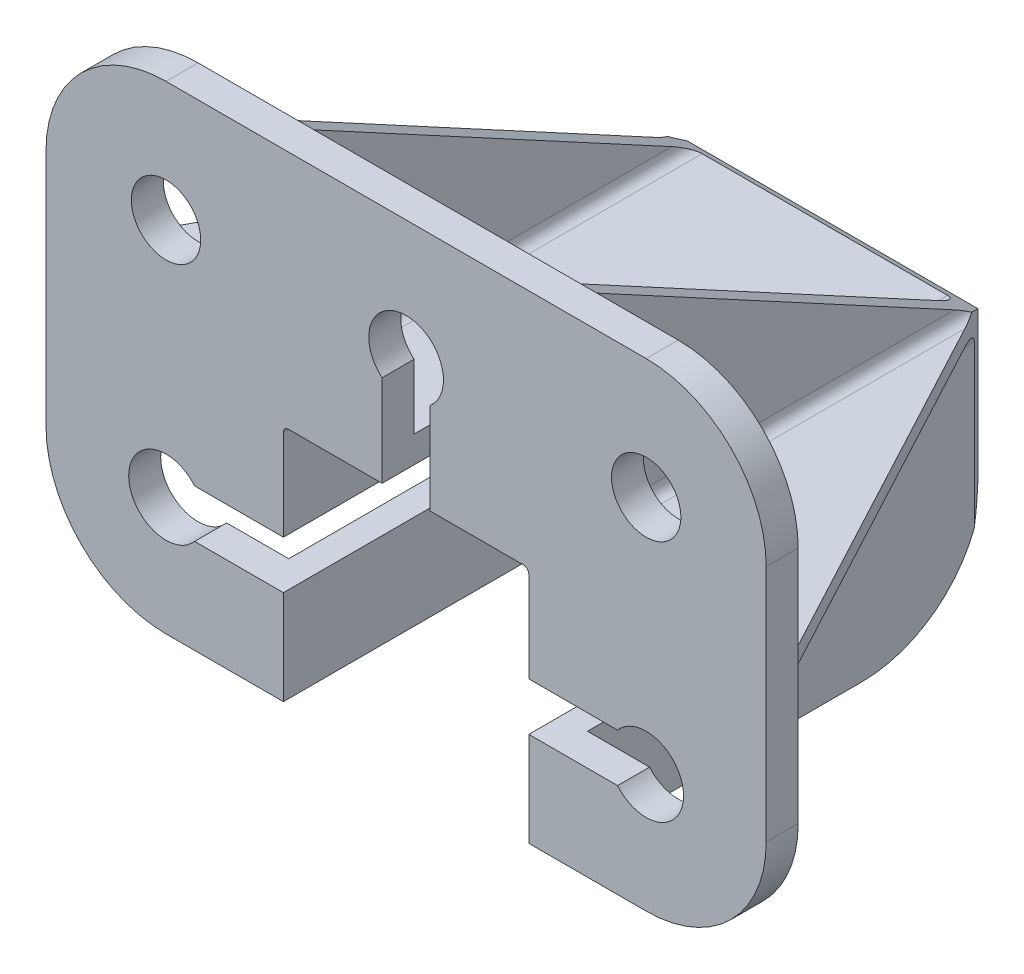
ISO-10303-21;
HEADER;
FILE_DESCRIPTION(('STEP AP214'),'2;1');
FILE_NAME('part.step','',(''),(''),'','','');
FILE_SCHEMA(('AUTOMOTIVE_DESIGN { 1 0 10303 214 1 1 1 1 }'));
ENDSEC;
DATA;
#1=APPLICATION_CONTEXT('core data for automotive mechanical design processes');
#2=APPLICATION_PROTOCOL_DEFINITION('international standard','automotive_design',2000,#1);
#3=PRODUCT_CONTEXT('',#1,'mechanical');
#4=PRODUCT('Part','Part','',(#3));
#5=PRODUCT_RELATED_PRODUCT_CATEGORY('part','',(#4));
#6=PRODUCT_DEFINITION_FORMATION('','',#4);
#7=PRODUCT_DEFINITION_CONTEXT('part definition',#1,'design');
#8=PRODUCT_DEFINITION('design','',#6,#7);
#9=PRODUCT_DEFINITION_SHAPE('','',#8);
#10=(LENGTH_UNIT() NAMED_UNIT(*) SI_UNIT(.MILLI.,.METRE.));
#11=(NAMED_UNIT(*) PLANE_ANGLE_UNIT() SI_UNIT($,.RADIAN.));
#12=(NAMED_UNIT(*) SI_UNIT($,.STERADIAN.) SOLID_ANGLE_UNIT());
#13=UNCERTAINTY_MEASURE_WITH_UNIT(LENGTH_MEASURE(1.E-05),#10,'distance_accuracy_value','');
#14=(GEOMETRIC_REPRESENTATION_CONTEXT(3) GLOBAL_UNCERTAINTY_ASSIGNED_CONTEXT((#13)) GLOBAL_UNIT_ASSIGNED_CONTEXT((#10,
#11,#12)) REPRESENTATION_CONTEXT('',''));
#15=CARTESIAN_POINT('',(0.,0.,0.));
#16=DIRECTION('',(0.,0.,1.));
#17=DIRECTION('',(1.,0.,0.));
#18=AXIS2_PLACEMENT_3D('',#15,#16,#17);
#19=CARTESIAN_POINT('',(-23.0000000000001,7.,0.));
#20=DIRECTION('',(0.,0.,-1.));
#21=DIRECTION('',(0.,1.,0.));
#22=AXIS2_PLACEMENT_3D('',#19,#20,#21);
#23=CYLINDRICAL_SURFACE('',#22,2.00000000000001);
#24=DIRECTION('',(0.,0.,-1.));
#25=VECTOR('',#24,1.);
#26=CARTESIAN_POINT('',(-25.0000000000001,7.,0.));
#27=LINE('',#26,#25);
#28=CARTESIAN_POINT('',(-25.0000000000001,7.,-6.));
#29=VERTEX_POINT('',#28);
#30=CARTESIAN_POINT('',(-25.0000000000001,6.99999999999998,-74.8058903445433));
#31=VERTEX_POINT('',#30);
#32=EDGE_CURVE('E399',#29,#31,#27,.T.);
#33=ORIENTED_EDGE('',*,*,#32,.F.);
#34=CARTESIAN_POINT('',(-23.0000000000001,7.,-6.));
#35=DIRECTION('',(0.,0.,-1.));
#36=DIRECTION('',(0.,1.,0.));
#37=AXIS2_PLACEMENT_3D('',#34,#35,#36);
#38=CIRCLE('',#37,2.00000000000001);
#39=CARTESIAN_POINT('',(-23.0000000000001,5.,-6.));
#40=VERTEX_POINT('',#39);
#41=EDGE_CURVE('E516',#40,#29,#38,.T.);
#42=ORIENTED_EDGE('',*,*,#41,.F.);
#43=DIRECTION('',(0.,0.,1.));
#44=VECTOR('',#43,1.);
#45=CARTESIAN_POINT('',(-23.0000000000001,5.,0.));
#46=LINE('',#45,#44);
#47=CARTESIAN_POINT('',(-23.0000000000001,4.99999999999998,-78.5058903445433));
#48=VERTEX_POINT('',#47);
#49=EDGE_CURVE('E407',#48,#40,#46,.T.);
#50=ORIENTED_EDGE('',*,*,#49,.F.);
#51=CARTESIAN_POINT('',(-23.0000000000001,6.99999999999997,-74.8058903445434));
#52=DIRECTION('',(0.,-0.879706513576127,0.475517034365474));
#53=DIRECTION('',(0.,-0.475517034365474,-0.879706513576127));
#54=AXIS2_PLACEMENT_3D('',#51,#52,#53);
#55=ELLIPSE('',#54,4.20594816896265,2.00000000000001);
#56=EDGE_CURVE('E547',#48,#31,#55,.F.);
#57=ORIENTED_EDGE('',*,*,#56,.T.);
#58=EDGE_LOOP('',(#33,#42,#50,#57));
#59=FACE_BOUND('',#58,.T.);
#60=ADVANCED_FACE('F34',(#59),#23,.F.);
#61=CARTESIAN_POINT('',(-25.0000000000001,7.,0.));
#62=DIRECTION('',(1.,0.,0.));
#63=DIRECTION('',(0.,0.,-1.));
#64=AXIS2_PLACEMENT_3D('',#61,#62,#63);
#65=PLANE('',#64);
#66=DIRECTION('',(0.,1.,0.));
#67=VECTOR('',#66,1.);
#68=CARTESIAN_POINT('',(-25.0000000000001,0.23941162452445,-6.));
#69=LINE('',#68,#67);
#70=CARTESIAN_POINT('',(-25.0000000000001,44.1923731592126,-6.));
#71=VERTEX_POINT('',#70);
#72=EDGE_CURVE('E404',#29,#71,#69,.T.);
#73=ORIENTED_EDGE('',*,*,#72,.F.);
#74=ORIENTED_EDGE('',*,*,#32,.T.);
#75=DIRECTION('',(0.,-0.475517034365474,-0.879706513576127));
#76=VECTOR('',#75,1.);
#77=CARTESIAN_POINT('',(-25.,44.1923731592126,-6.00000000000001));
#78=LINE('',#77,#76);
#79=EDGE_CURVE('E549',#31,#71,#78,.F.);
#80=ORIENTED_EDGE('',*,*,#79,.T.);
#81=EDGE_LOOP('',(#73,#74,#80));
#82=FACE_BOUND('',#81,.T.);
#83=ADVANCED_FACE('F1095',(#82),#65,.T.);
#84=CARTESIAN_POINT('',(-28.0000000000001,45.,0.));
#85=DIRECTION('',(-1.,0.,0.));
#86=DIRECTION('',(0.,0.,1.));
#87=AXIS2_PLACEMENT_3D('',#84,#85,#86);
#88=PLANE('',#87);
#89=DIRECTION('',(0.,0.,-1.));
#90=VECTOR('',#89,1.);
#91=CARTESIAN_POINT('',(-28.0000000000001,6.99999999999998,0.));
#92=LINE('',#91,#90);
#93=CARTESIAN_POINT('',(-28.0000000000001,6.99999999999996,-74.8058903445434));
#94=VERTEX_POINT('',#93);
#95=CARTESIAN_POINT('',(-28.0000000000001,6.99999999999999,-6.));
#96=VERTEX_POINT('',#95);
#97=EDGE_CURVE('E355',#94,#96,#92,.F.);
#98=ORIENTED_EDGE('',*,*,#97,.T.);
#99=DIRECTION('',(0.,1.,0.));
#100=VECTOR('',#99,1.);
#101=CARTESIAN_POINT('',(-28.0000000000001,0.23941162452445,-6.));
#102=LINE('',#101,#100);
#103=CARTESIAN_POINT('',(-28.0000000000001,44.1923731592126,-6.));
#104=VERTEX_POINT('',#103);
#105=EDGE_CURVE('E403',#104,#96,#102,.F.);
#106=ORIENTED_EDGE('',*,*,#105,.F.);
#107=DIRECTION('',(0.,-0.475517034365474,-0.879706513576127));
#108=VECTOR('',#107,1.);
#109=CARTESIAN_POINT('',(-28.0000000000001,44.1923731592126,-6.00000000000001));
#110=LINE('',#109,#108);
#111=EDGE_CURVE('E356',#104,#94,#110,.T.);
#112=ORIENTED_EDGE('',*,*,#111,.T.);
#113=EDGE_LOOP('',(#98,#106,#112));
#114=FACE_BOUND('',#113,.T.);
#115=ADVANCED_FACE('F1099',(#114),#88,.T.);
#116=CARTESIAN_POINT('',(-30.0000000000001,7.,0.));
#117=DIRECTION('',(0.,0.,-1.));
#118=DIRECTION('',(0.,1.,0.));
#119=AXIS2_PLACEMENT_3D('',#116,#117,#118);
#120=CYLINDRICAL_SURFACE('',#119,2.00000000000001);
#121=CARTESIAN_POINT('',(-30.0000000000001,6.99999999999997,-74.7535371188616));
#122=DIRECTION('',(0.882187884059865,0.,0.470897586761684));
#123=DIRECTION('',(0.470897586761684,0.,-0.882187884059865));
#124=AXIS2_PLACEMENT_3D('',#121,#122,#123);
#125=ELLIPSE('',#124,4.24720800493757,2.00000000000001);
#126=CARTESIAN_POINT('',(-28.5806297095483,5.59096203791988,-77.4126105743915));
#127=VERTEX_POINT('',#126);
#128=CARTESIAN_POINT('',(-30.0000000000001,4.99999999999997,-74.7535371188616));
#129=VERTEX_POINT('',#128);
#130=EDGE_CURVE('E37',#127,#129,#125,.F.);
#131=ORIENTED_EDGE('',*,*,#130,.T.);
#132=DIRECTION('',(0.,0.,1.));
#133=VECTOR('',#132,1.);
#134=CARTESIAN_POINT('',(-30.0000000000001,5.,0.));
#135=LINE('',#134,#133);
#136=CARTESIAN_POINT('',(-30.0000000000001,5.,-6.));
#137=VERTEX_POINT('',#136);
#138=EDGE_CURVE('E340',#137,#129,#135,.F.);
#139=ORIENTED_EDGE('',*,*,#138,.F.);
#140=CARTESIAN_POINT('',(-30.0000000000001,7.,-6.));
#141=DIRECTION('',(0.,0.,-1.));
#142=DIRECTION('',(0.,1.,0.));
#143=AXIS2_PLACEMENT_3D('',#140,#141,#142);
#144=CIRCLE('',#143,2.00000000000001);
#145=EDGE_CURVE('E514',#96,#137,#144,.T.);
#146=ORIENTED_EDGE('',*,*,#145,.F.);
#147=ORIENTED_EDGE('',*,*,#97,.F.);
#148=CARTESIAN_POINT('',(-30.0000000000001,6.99999999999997,-74.8058903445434));
#149=DIRECTION('',(0.,-0.879706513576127,0.475517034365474));
#150=DIRECTION('',(0.,-0.475517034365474,-0.879706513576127));
#151=AXIS2_PLACEMENT_3D('',#148,#149,#150);
#152=ELLIPSE('',#151,4.20594816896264,2.00000000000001);
#153=EDGE_CURVE('E345',#94,#127,#152,.F.);
#154=ORIENTED_EDGE('',*,*,#153,.T.);
#155=EDGE_LOOP('',(#131,#139,#146,#147,#154));
#156=FACE_BOUND('',#155,.T.);
#157=ADVANCED_FACE('F352',(#156),#120,.F.);
#158=CARTESIAN_POINT('',(-30.0000000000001,5.,0.));
#159=DIRECTION('',(0.,1.,0.));
#160=DIRECTION('',(0.,0.,1.));
#161=AXIS2_PLACEMENT_3D('',#158,#159,#160);
#162=PLANE('',#161);
#163=DIRECTION('',(-1.,0.,0.));
#164=VECTOR('',#163,1.);
#165=CARTESIAN_POINT('',(0.,5.,-6.));
#166=LINE('',#165,#164);
#167=CARTESIAN_POINT('',(-66.6995231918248,4.99999999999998,-6.));
#168=VERTEX_POINT('',#167);
#169=EDGE_CURVE('E394',#137,#168,#166,.T.);
#170=ORIENTED_EDGE('',*,*,#169,.F.);
#171=ORIENTED_EDGE('',*,*,#138,.T.);
#172=DIRECTION('',(0.470897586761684,0.,-0.882187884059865));
#173=VECTOR('',#172,1.);
#174=CARTESIAN_POINT('',(-66.6995231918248,4.99999999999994,-6.00000000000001));
#175=LINE('',#174,#173);
#176=EDGE_CURVE('E336',#129,#168,#175,.F.);
#177=ORIENTED_EDGE('',*,*,#176,.T.);
#178=EDGE_LOOP('',(#170,#171,#177));
#179=FACE_BOUND('',#178,.T.);
#180=ADVANCED_FACE('F853',(#179),#162,.T.);
#181=CARTESIAN_POINT('',(-66.6995231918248,45.,-6.00000000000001));
#182=DIRECTION('',(0.882187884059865,0.,0.470897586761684));
#183=DIRECTION('',(0.470897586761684,0.,-0.882187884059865));
#184=AXIS2_PLACEMENT_3D('',#181,#182,#183);
#185=PLANE('',#184);
#186=DIRECTION('',(0.,1.,0.));
#187=VECTOR('',#186,1.);
#188=CARTESIAN_POINT('',(-28.,-22.5,-78.5003725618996));
#189=LINE('',#188,#187);
#190=CARTESIAN_POINT('',(-28.,0.,-78.5003725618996));
#191=VERTEX_POINT('',#190);
#192=CARTESIAN_POINT('',(-28.,-30.2767785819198,-78.5003725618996));
#193=VERTEX_POINT('',#192);
#194=EDGE_CURVE('E539',#191,#193,#189,.F.);
#195=ORIENTED_EDGE('',*,*,#194,.F.);
#196=CARTESIAN_POINT('',(-30.0000000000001,0.,-74.7535371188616));
#197=DIRECTION('',(0.882187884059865,0.,0.470897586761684));
#198=DIRECTION('',(0.470897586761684,0.,-0.882187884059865));
#199=AXIS2_PLACEMENT_3D('',#196,#197,#198);
#200=ELLIPSE('',#199,4.24720800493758,2.00000000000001);
#201=CARTESIAN_POINT('',(-30.0000000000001,1.99999999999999,-74.7535371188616));
#202=VERTEX_POINT('',#201);
#203=EDGE_CURVE('E373',#191,#202,#200,.T.);
#204=ORIENTED_EDGE('',*,*,#203,.T.);
#205=DIRECTION('',(0.470897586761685,0.,-0.882187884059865));
#206=VECTOR('',#205,1.);
#207=CARTESIAN_POINT('',(-66.6995231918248,2.,-5.99999999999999));
#208=LINE('',#207,#206);
#209=CARTESIAN_POINT('',(-66.6995231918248,2.,-6.));
#210=VERTEX_POINT('',#209);
#211=EDGE_CURVE('E379',#210,#202,#208,.T.);
#212=ORIENTED_EDGE('',*,*,#211,.F.);
#213=DIRECTION('',(0.,1.,0.));
#214=VECTOR('',#213,1.);
#215=CARTESIAN_POINT('',(-66.6995231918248,0.23941162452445,-6.));
#216=LINE('',#215,#214);
#217=EDGE_CURVE('E390',#168,#210,#216,.F.);
#218=ORIENTED_EDGE('',*,*,#217,.F.);
#219=ORIENTED_EDGE('',*,*,#176,.F.);
#220=ORIENTED_EDGE('',*,*,#130,.F.);
#221=DIRECTION('',(0.425044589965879,-0.430424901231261,-0.796286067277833));
#222=VECTOR('',#221,1.);
#223=CARTESIAN_POINT('',(-28.5806297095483,5.59096203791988,-77.4126105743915));
#224=LINE('',#223,#222);
#225=CARTESIAN_POINT('',(-27.1995231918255,4.19237315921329,-79.9999999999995));
#226=VERTEX_POINT('',#225);
#227=EDGE_CURVE('E332',#127,#226,#224,.T.);
#228=ORIENTED_EDGE('',*,*,#227,.T.);
#229=DIRECTION('',(0.,1.,0.));
#230=VECTOR('',#229,1.);
#231=CARTESIAN_POINT('',(-27.1995231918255,1.03586887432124,-80.));
#232=LINE('',#231,#230);
#233=CARTESIAN_POINT('',(-27.1995231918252,-22.2000000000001,-79.9999999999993));
#234=VERTEX_POINT('',#233);
#235=EDGE_CURVE('E418',#234,#226,#232,.T.);
#236=ORIENTED_EDGE('',*,*,#235,.F.);
#237=CARTESIAN_POINT('',(-39.2096583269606,-22.2000000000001,-57.4999999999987));
#238=DIRECTION('',(0.882187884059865,0.,0.470897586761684));
#239=DIRECTION('',(-0.470897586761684,0.,0.882187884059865));
#240=AXIS2_PLACEMENT_3D('',#237,#238,#239);
#241=ELLIPSE('',#240,25.5047710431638,22.5);
#242=EDGE_CURVE('E542',#193,#234,#241,.T.);
#243=ORIENTED_EDGE('',*,*,#242,.F.);
#244=EDGE_LOOP('',(#195,#204,#212,#218,#219,#220,#228,#236,#243));
#245=FACE_BOUND('',#244,.T.);
#246=ADVANCED_FACE('F330',(#245),#185,.F.);
#247=CARTESIAN_POINT('',(-67.4999999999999,2.,0.));
#248=DIRECTION('',(0.,-1.,0.));
#249=DIRECTION('',(0.,0.,-1.));
#250=AXIS2_PLACEMENT_3D('',#247,#248,#249);
#251=PLANE('',#250);
#252=DIRECTION('',(0.,0.,-1.));
#253=VECTOR('',#252,1.);
#254=CARTESIAN_POINT('',(-30.0000000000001,2.00000000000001,0.));
#255=LINE('',#254,#253);
#256=CARTESIAN_POINT('',(-30.0000000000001,2.00000000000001,-6.));
#257=VERTEX_POINT('',#256);
#258=EDGE_CURVE('E375',#202,#257,#255,.F.);
#259=ORIENTED_EDGE('',*,*,#258,.T.);
#260=DIRECTION('',(-1.,0.,0.));
#261=VECTOR('',#260,1.);
#262=CARTESIAN_POINT('',(0.,2.,-6.));
#263=LINE('',#262,#261);
#264=EDGE_CURVE('E393',#210,#257,#263,.F.);
#265=ORIENTED_EDGE('',*,*,#264,.F.);
#266=ORIENTED_EDGE('',*,*,#211,.T.);
#267=EDGE_LOOP('',(#259,#265,#266));
#268=FACE_BOUND('',#267,.T.);
#269=ADVANCED_FACE('F854',(#268),#251,.T.);
#270=CARTESIAN_POINT('',(-30.0000000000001,0.,0.));
#271=DIRECTION('',(0.,0.,-1.));
#272=DIRECTION('',(0.,1.,0.));
#273=AXIS2_PLACEMENT_3D('',#270,#271,#272);
#274=CYLINDRICAL_SURFACE('',#273,2.00000000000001);
#275=DIRECTION('',(0.,0.,1.));
#276=VECTOR('',#275,1.);
#277=CARTESIAN_POINT('',(-28.,0.,0.));
#278=LINE('',#277,#276);
#279=CARTESIAN_POINT('',(-28.,0.,-6.));
#280=VERTEX_POINT('',#279);
#281=EDGE_CURVE('E387',#280,#191,#278,.F.);
#282=ORIENTED_EDGE('',*,*,#281,.F.);
#283=CARTESIAN_POINT('',(-30.0000000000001,0.,-5.99999999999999));
#284=DIRECTION('',(0.,0.,-1.));
#285=DIRECTION('',(0.,1.,0.));
#286=AXIS2_PLACEMENT_3D('',#283,#284,#285);
#287=CIRCLE('',#286,2.00000000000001);
#288=EDGE_CURVE('E511',#257,#280,#287,.T.);
#289=ORIENTED_EDGE('',*,*,#288,.F.);
#290=ORIENTED_EDGE('',*,*,#258,.F.);
#291=ORIENTED_EDGE('',*,*,#203,.F.);
#292=EDGE_LOOP('',(#282,#289,#290,#291));
#293=FACE_BOUND('',#292,.T.);
#294=ADVANCED_FACE('F860',(#293),#274,.F.);
#295=CARTESIAN_POINT('',(30.0000000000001,0.,0.));
#296=DIRECTION('',(0.,0.,-1.));
#297=DIRECTION('',(0.,1.,0.));
#298=AXIS2_PLACEMENT_3D('',#295,#296,#297);
#299=CYLINDRICAL_SURFACE('',#298,2.00000000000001);
#300=DIRECTION('',(0.,0.,-1.));
#301=VECTOR('',#300,1.);
#302=CARTESIAN_POINT('',(30.0000000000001,2.,0.));
#303=LINE('',#302,#301);
#304=CARTESIAN_POINT('',(30.0000000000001,2.,-6.));
#305=VERTEX_POINT('',#304);
#306=CARTESIAN_POINT('',(30.0000000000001,1.99999999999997,-74.7535371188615));
#307=VERTEX_POINT('',#306);
#308=EDGE_CURVE('E372',#305,#307,#303,.T.);
#309=ORIENTED_EDGE('',*,*,#308,.F.);
#310=CARTESIAN_POINT('',(30.0000000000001,0.,-6.));
#311=DIRECTION('',(0.,0.,-1.));
#312=DIRECTION('',(0.,1.,0.));
#313=AXIS2_PLACEMENT_3D('',#310,#311,#312);
#314=CIRCLE('',#313,2.00000000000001);
#315=CARTESIAN_POINT('',(28.0000000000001,0.,-6.));
#316=VERTEX_POINT('',#315);
#317=EDGE_CURVE('E507',#316,#305,#314,.T.);
#318=ORIENTED_EDGE('',*,*,#317,.F.);
#319=DIRECTION('',(0.,0.,-1.));
#320=VECTOR('',#319,1.);
#321=CARTESIAN_POINT('',(28.0000000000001,0.,0.));
#322=LINE('',#321,#320);
#323=CARTESIAN_POINT('',(28.0000000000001,0.,-78.5003725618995));
#324=VERTEX_POINT('',#323);
#325=EDGE_CURVE('E535',#324,#316,#322,.F.);
#326=ORIENTED_EDGE('',*,*,#325,.F.);
#327=CARTESIAN_POINT('',(30.0000000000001,0.,-74.7535371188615));
#328=DIRECTION('',(-0.882187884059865,0.,0.470897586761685));
#329=DIRECTION('',(-0.470897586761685,0.,-0.882187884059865));
#330=AXIS2_PLACEMENT_3D('',#327,#328,#329);
#331=ELLIPSE('',#330,4.24720800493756,2.00000000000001);
#332=EDGE_CURVE('E369',#324,#307,#331,.F.);
#333=ORIENTED_EDGE('',*,*,#332,.T.);
#334=EDGE_LOOP('',(#309,#318,#326,#333));
#335=FACE_BOUND('',#334,.T.);
#336=ADVANCED_FACE('F964',(#335),#299,.F.);
#337=CARTESIAN_POINT('',(30.0000000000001,2.,0.));
#338=DIRECTION('',(0.,-1.,0.));
#339=DIRECTION('',(0.,0.,-1.));
#340=AXIS2_PLACEMENT_3D('',#337,#338,#339);
#341=PLANE('',#340);
#342=DIRECTION('',(-1.,0.,0.));
#343=VECTOR('',#342,1.);
#344=CARTESIAN_POINT('',(0.,2.,-6.));
#345=LINE('',#344,#343);
#346=CARTESIAN_POINT('',(66.6995231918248,1.99999999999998,-6.));
#347=VERTEX_POINT('',#346);
#348=EDGE_CURVE('E509',#305,#347,#345,.F.);
#349=ORIENTED_EDGE('',*,*,#348,.F.);
#350=ORIENTED_EDGE('',*,*,#308,.T.);
#351=DIRECTION('',(0.470897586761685,0.,0.882187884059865));
#352=VECTOR('',#351,1.);
#353=CARTESIAN_POINT('',(27.1995231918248,1.99999999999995,-80.0000000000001));
#354=LINE('',#353,#352);
#355=EDGE_CURVE('E371',#307,#347,#354,.T.);
#356=ORIENTED_EDGE('',*,*,#355,.T.);
#357=EDGE_LOOP('',(#349,#350,#356));
#358=FACE_BOUND('',#357,.T.);
#359=ADVANCED_FACE('F968',(#358),#341,.T.);
#360=CARTESIAN_POINT('',(27.1995231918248,44.9999999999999,-80.0000000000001));
#361=DIRECTION('',(-0.882187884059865,0.,0.470897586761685));
#362=DIRECTION('',(0.470897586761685,0.,0.882187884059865));
#363=AXIS2_PLACEMENT_3D('',#360,#361,#362);
#364=PLANE('',#363);
#365=CARTESIAN_POINT('',(30.,6.99999999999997,-74.7535371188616));
#366=DIRECTION('',(-0.882187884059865,0.,0.470897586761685));
#367=DIRECTION('',(-0.470897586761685,0.,-0.882187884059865));
#368=AXIS2_PLACEMENT_3D('',#365,#366,#367);
#369=ELLIPSE('',#368,4.24720800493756,2.00000000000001);
#370=CARTESIAN_POINT('',(28.5806297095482,5.59096203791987,-77.4126105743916));
#371=VERTEX_POINT('',#370);
#372=CARTESIAN_POINT('',(30.,4.99999999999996,-74.7535371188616));
#373=VERTEX_POINT('',#372);
#374=EDGE_CURVE('E364',#371,#373,#369,.T.);
#375=ORIENTED_EDGE('',*,*,#374,.T.);
#376=DIRECTION('',(-0.470897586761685,0.,-0.882187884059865));
#377=VECTOR('',#376,1.);
#378=CARTESIAN_POINT('',(66.6995231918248,5.,-6.00000000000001));
#379=LINE('',#378,#377);
#380=CARTESIAN_POINT('',(66.6995231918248,5.,-6.));
#381=VERTEX_POINT('',#380);
#382=EDGE_CURVE('E368',#381,#373,#379,.T.);
#383=ORIENTED_EDGE('',*,*,#382,.F.);
#384=DIRECTION('',(0.,1.,0.));
#385=VECTOR('',#384,1.);
#386=CARTESIAN_POINT('',(66.6995231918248,0.23941162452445,-6.));
#387=LINE('',#386,#385);
#388=EDGE_CURVE('E572',#347,#381,#387,.T.);
#389=ORIENTED_EDGE('',*,*,#388,.F.);
#390=ORIENTED_EDGE('',*,*,#355,.F.);
#391=ORIENTED_EDGE('',*,*,#332,.F.);
#392=DIRECTION('',(0.,1.,0.));
#393=VECTOR('',#392,1.);
#394=CARTESIAN_POINT('',(28.0000000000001,-22.5,-78.5003725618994));
#395=LINE('',#394,#393);
#396=CARTESIAN_POINT('',(28.0000000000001,-30.2767785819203,-78.5003725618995));
#397=VERTEX_POINT('',#396);
#398=EDGE_CURVE('E538',#397,#324,#395,.T.);
#399=ORIENTED_EDGE('',*,*,#398,.F.);
#400=CARTESIAN_POINT('',(39.2096583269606,-22.2,-57.4999999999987));
#401=DIRECTION('',(-0.882187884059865,0.,0.470897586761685));
#402=DIRECTION('',(-0.470897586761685,0.,-0.882187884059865));
#403=AXIS2_PLACEMENT_3D('',#400,#401,#402);
#404=ELLIPSE('',#403,25.5047710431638,22.5);
#405=CARTESIAN_POINT('',(27.1995231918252,-22.2000000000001,-79.9999999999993));
#406=VERTEX_POINT('',#405);
#407=EDGE_CURVE('E531',#406,#397,#404,.T.);
#408=ORIENTED_EDGE('',*,*,#407,.F.);
#409=DIRECTION('',(0.,1.,0.));
#410=VECTOR('',#409,1.);
#411=CARTESIAN_POINT('',(27.1995231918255,1.03586887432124,-80.));
#412=LINE('',#411,#410);
#413=CARTESIAN_POINT('',(27.1995231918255,4.19237315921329,-79.9999999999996));
#414=VERTEX_POINT('',#413);
#415=EDGE_CURVE('E414',#414,#406,#412,.F.);
#416=ORIENTED_EDGE('',*,*,#415,.F.);
#417=DIRECTION('',(0.425044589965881,0.430424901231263,0.796286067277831));
#418=VECTOR('',#417,1.);
#419=CARTESIAN_POINT('',(27.1995231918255,4.19237315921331,-79.9999999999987));
#420=LINE('',#419,#418);
#421=EDGE_CURVE('E350',#414,#371,#420,.T.);
#422=ORIENTED_EDGE('',*,*,#421,.T.);
#423=EDGE_LOOP('',(#375,#383,#389,#390,#391,#399,#408,#416,#422));
#424=FACE_BOUND('',#423,.T.);
#425=ADVANCED_FACE('F973',(#424),#364,.F.);
#426=CARTESIAN_POINT('',(67.5,5.,0.));
#427=DIRECTION('',(0.,1.,0.));
#428=DIRECTION('',(0.,0.,1.));
#429=AXIS2_PLACEMENT_3D('',#426,#427,#428);
#430=PLANE('',#429);
#431=DIRECTION('',(0.,0.,-1.));
#432=VECTOR('',#431,1.);
#433=CARTESIAN_POINT('',(30.,4.99999999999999,0.));
#434=LINE('',#433,#432);
#435=CARTESIAN_POINT('',(30.,5.,-6.00000000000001));
#436=VERTEX_POINT('',#435);
#437=EDGE_CURVE('E367',#373,#436,#434,.F.);
#438=ORIENTED_EDGE('',*,*,#437,.T.);
#439=DIRECTION('',(-1.,0.,0.));
#440=VECTOR('',#439,1.);
#441=CARTESIAN_POINT('',(0.,5.,-6.));
#442=LINE('',#441,#440);
#443=EDGE_CURVE('E506',#381,#436,#442,.T.);
#444=ORIENTED_EDGE('',*,*,#443,.F.);
#445=ORIENTED_EDGE('',*,*,#382,.T.);
#446=EDGE_LOOP('',(#438,#444,#445));
#447=FACE_BOUND('',#446,.T.);
#448=ADVANCED_FACE('F976',(#447),#430,.T.);
#449=CARTESIAN_POINT('',(30.,7.,0.));
#450=DIRECTION('',(0.,0.,-1.));
#451=DIRECTION('',(0.,1.,0.));
#452=AXIS2_PLACEMENT_3D('',#449,#450,#451);
#453=CYLINDRICAL_SURFACE('',#452,2.00000000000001);
#454=DIRECTION('',(0.,0.,-1.));
#455=VECTOR('',#454,1.);
#456=CARTESIAN_POINT('',(28.,7.,0.));
#457=LINE('',#456,#455);
#458=CARTESIAN_POINT('',(28.,7.,-6.));
#459=VERTEX_POINT('',#458);
#460=CARTESIAN_POINT('',(28.,6.99999999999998,-74.8058903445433));
#461=VERTEX_POINT('',#460);
#462=EDGE_CURVE('E358',#459,#461,#457,.T.);
#463=ORIENTED_EDGE('',*,*,#462,.F.);
#464=CARTESIAN_POINT('',(30.,7.,-6.00000000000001));
#465=DIRECTION('',(0.,0.,-1.));
#466=DIRECTION('',(0.,1.,0.));
#467=AXIS2_PLACEMENT_3D('',#464,#465,#466);
#468=CIRCLE('',#467,2.00000000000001);
#469=EDGE_CURVE('E503',#436,#459,#468,.T.);
#470=ORIENTED_EDGE('',*,*,#469,.F.);
#471=ORIENTED_EDGE('',*,*,#437,.F.);
#472=ORIENTED_EDGE('',*,*,#374,.F.);
#473=CARTESIAN_POINT('',(30.,6.99999999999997,-74.8058903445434));
#474=DIRECTION('',(0.,-0.879706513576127,0.475517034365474));
#475=DIRECTION('',(0.,-0.475517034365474,-0.879706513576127));
#476=AXIS2_PLACEMENT_3D('',#473,#474,#475);
#477=ELLIPSE('',#476,4.20594816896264,2.00000000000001);
#478=EDGE_CURVE('E362',#371,#461,#477,.F.);
#479=ORIENTED_EDGE('',*,*,#478,.T.);
#480=EDGE_LOOP('',(#463,#470,#471,#472,#479));
#481=FACE_BOUND('',#480,.T.);
#482=ADVANCED_FACE('F980',(#481),#453,.F.);
#483=CARTESIAN_POINT('',(28.,7.,0.));
#484=DIRECTION('',(1.,0.,0.));
#485=DIRECTION('',(0.,0.,-1.));
#486=AXIS2_PLACEMENT_3D('',#483,#484,#485);
#487=PLANE('',#486);
#488=DIRECTION('',(0.,1.,0.));
#489=VECTOR('',#488,1.);
#490=CARTESIAN_POINT('',(28.,0.23941162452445,-6.));
#491=LINE('',#490,#489);
#492=CARTESIAN_POINT('',(28.,44.1923731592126,-6.));
#493=VERTEX_POINT('',#492);
#494=EDGE_CURVE('E505',#459,#493,#491,.T.);
#495=ORIENTED_EDGE('',*,*,#494,.F.);
#496=ORIENTED_EDGE('',*,*,#462,.T.);
#497=DIRECTION('',(0.,-0.475517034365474,-0.879706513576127));
#498=VECTOR('',#497,1.);
#499=CARTESIAN_POINT('',(28.,44.1923731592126,-6.00000000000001));
#500=LINE('',#499,#498);
#501=EDGE_CURVE('E550',#461,#493,#500,.F.);
#502=ORIENTED_EDGE('',*,*,#501,.T.);
#503=EDGE_LOOP('',(#495,#496,#502));
#504=FACE_BOUND('',#503,.T.);
#505=ADVANCED_FACE('F982',(#504),#487,.T.);
#506=CARTESIAN_POINT('',(67.5,44.1923731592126,-6.00000000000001));
#507=DIRECTION('',(0.,-0.879706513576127,0.475517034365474));
#508=DIRECTION('',(0.,-0.475517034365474,-0.879706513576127));
#509=AXIS2_PLACEMENT_3D('',#506,#507,#508);
#510=PLANE('',#509);
#511=ORIENTED_EDGE('',*,*,#56,.F.);
#512=DIRECTION('',(1.,0.,0.));
#513=VECTOR('',#512,1.);
#514=CARTESIAN_POINT('',(22.9999999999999,5.,-78.5058903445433));
#515=LINE('',#514,#513);
#516=CARTESIAN_POINT('',(22.9999999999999,4.99999999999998,-78.5058903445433));
#517=VERTEX_POINT('',#516);
#518=EDGE_CURVE('E410',#517,#48,#515,.F.);
#519=ORIENTED_EDGE('',*,*,#518,.F.);
#520=CARTESIAN_POINT('',(22.9999999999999,6.99999999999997,-74.8058903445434));
#521=DIRECTION('',(0.,-0.879706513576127,0.475517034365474));
#522=DIRECTION('',(0.,-0.475517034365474,-0.879706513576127));
#523=AXIS2_PLACEMENT_3D('',#520,#521,#522);
#524=ELLIPSE('',#523,4.20594816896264,2.00000000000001);
#525=CARTESIAN_POINT('',(24.9999999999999,6.99999999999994,-74.8058903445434));
#526=VERTEX_POINT('',#525);
#527=EDGE_CURVE('E544',#517,#526,#524,.T.);
#528=ORIENTED_EDGE('',*,*,#527,.T.);
#529=DIRECTION('',(0.,-0.475517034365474,-0.879706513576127));
#530=VECTOR('',#529,1.);
#531=CARTESIAN_POINT('',(24.9999999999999,44.1923731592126,-6.00000000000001));
#532=LINE('',#531,#530);
#533=CARTESIAN_POINT('',(25.,44.1923731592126,-6.));
#534=VERTEX_POINT('',#533);
#535=EDGE_CURVE('E555',#534,#526,#532,.T.);
#536=ORIENTED_EDGE('',*,*,#535,.F.);
#537=DIRECTION('',(-1.,0.,0.));
#538=VECTOR('',#537,1.);
#539=CARTESIAN_POINT('',(0.,44.1923731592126,-6.));
#540=LINE('',#539,#538);
#541=EDGE_CURVE('E650',#493,#534,#540,.T.);
#542=ORIENTED_EDGE('',*,*,#541,.F.);
#543=ORIENTED_EDGE('',*,*,#501,.F.);
#544=ORIENTED_EDGE('',*,*,#478,.F.);
#545=ORIENTED_EDGE('',*,*,#421,.F.);
#546=DIRECTION('',(-1.,0.,0.));
#547=VECTOR('',#546,1.);
#548=CARTESIAN_POINT('',(0.,4.19237315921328,-80.));
#549=LINE('',#548,#547);
#550=EDGE_CURVE('E349',#226,#414,#549,.F.);
#551=ORIENTED_EDGE('',*,*,#550,.F.);
#552=ORIENTED_EDGE('',*,*,#227,.F.);
#553=ORIENTED_EDGE('',*,*,#153,.F.);
#554=ORIENTED_EDGE('',*,*,#111,.F.);
#555=DIRECTION('',(-1.,0.,0.));
#556=VECTOR('',#555,1.);
#557=CARTESIAN_POINT('',(0.,44.1923731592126,-6.));
#558=LINE('',#557,#556);
#559=EDGE_CURVE('E400',#71,#104,#558,.T.);
#560=ORIENTED_EDGE('',*,*,#559,.F.);
#561=ORIENTED_EDGE('',*,*,#79,.F.);
#562=EDGE_LOOP('',(#511,#519,#528,#536,#542,#543,#544,#545,#551,#552,#553,#554,#560,#561));
#563=FACE_BOUND('',#562,.T.);
#564=ADVANCED_FACE('F343',(#563),#510,.F.);
#565=CARTESIAN_POINT('',(24.9999999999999,45.,0.));
#566=DIRECTION('',(-1.,0.,0.));
#567=DIRECTION('',(0.,0.,1.));
#568=AXIS2_PLACEMENT_3D('',#565,#566,#567);
#569=PLANE('',#568);
#570=DIRECTION('',(0.,0.,-1.));
#571=VECTOR('',#570,1.);
#572=CARTESIAN_POINT('',(25.,6.99999999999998,0.));
#573=LINE('',#572,#571);
#574=CARTESIAN_POINT('',(25.,6.99999999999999,-6.00000000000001));
#575=VERTEX_POINT('',#574);
#576=EDGE_CURVE('E546',#526,#575,#573,.F.);
#577=ORIENTED_EDGE('',*,*,#576,.T.);
#578=DIRECTION('',(0.,1.,0.));
#579=VECTOR('',#578,1.);
#580=CARTESIAN_POINT('',(24.9999999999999,0.23941162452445,-6.));
#581=LINE('',#580,#579);
#582=EDGE_CURVE('E502',#534,#575,#581,.F.);
#583=ORIENTED_EDGE('',*,*,#582,.F.);
#584=ORIENTED_EDGE('',*,*,#535,.T.);
#585=EDGE_LOOP('',(#577,#583,#584));
#586=FACE_BOUND('',#585,.T.);
#587=ADVANCED_FACE('F989',(#586),#569,.T.);
#588=CARTESIAN_POINT('',(22.9999999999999,7.,0.));
#589=DIRECTION('',(0.,0.,-1.));
#590=DIRECTION('',(0.,1.,0.));
#591=AXIS2_PLACEMENT_3D('',#588,#589,#590);
#592=CYLINDRICAL_SURFACE('',#591,2.00000000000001);
#593=DIRECTION('',(0.,0.,1.));
#594=VECTOR('',#593,1.);
#595=CARTESIAN_POINT('',(22.9999999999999,5.,0.));
#596=LINE('',#595,#594);
#597=CARTESIAN_POINT('',(22.9999999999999,5.,-6.));
#598=VERTEX_POINT('',#597);
#599=EDGE_CURVE('E413',#598,#517,#596,.F.);
#600=ORIENTED_EDGE('',*,*,#599,.F.);
#601=CARTESIAN_POINT('',(22.9999999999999,7.,-6.00000000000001));
#602=DIRECTION('',(0.,0.,-1.));
#603=DIRECTION('',(0.,1.,0.));
#604=AXIS2_PLACEMENT_3D('',#601,#602,#603);
#605=CIRCLE('',#604,2.00000000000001);
#606=EDGE_CURVE('E499',#575,#598,#605,.T.);
#607=ORIENTED_EDGE('',*,*,#606,.F.);
#608=ORIENTED_EDGE('',*,*,#576,.F.);
#609=ORIENTED_EDGE('',*,*,#527,.F.);
#610=EDGE_LOOP('',(#600,#607,#608,#609));
#611=FACE_BOUND('',#610,.T.);
#612=ADVANCED_FACE('F1080',(#611),#592,.F.);
#613=CARTESIAN_POINT('',(-25.5,-22.5,-45.));
#614=DIRECTION('',(-1.,0.,0.));
#615=DIRECTION('',(0.,-1.,0.));
#616=AXIS2_PLACEMENT_3D('',#613,#614,#615);
#617=CYLINDRICAL_SURFACE('',#616,4.5);
#618=CARTESIAN_POINT('',(-23.,-22.5,-45.));
#619=DIRECTION('',(-1.,0.,0.));
#620=DIRECTION('',(0.,-1.,0.));
#621=AXIS2_PLACEMENT_3D('',#618,#619,#620);
#622=CIRCLE('',#621,4.5);
#623=CARTESIAN_POINT('',(-23.,-18.,-45.));
#624=VERTEX_POINT('',#623);
#625=CARTESIAN_POINT('',(-23.,-27.,-45.));
#626=VERTEX_POINT('',#625);
#627=EDGE_CURVE('E492',#624,#626,#622,.T.);
#628=ORIENTED_EDGE('',*,*,#627,.F.);
#629=DIRECTION('',(1.,0.,0.));
#630=VECTOR('',#629,1.);
#631=CARTESIAN_POINT('',(0.,-18.,-45.));
#632=LINE('',#631,#630);
#633=CARTESIAN_POINT('',(-28.,-18.,-45.));
#634=VERTEX_POINT('',#633);
#635=EDGE_CURVE('E628',#624,#634,#632,.F.);
#636=ORIENTED_EDGE('',*,*,#635,.T.);
#637=CARTESIAN_POINT('',(-28.,-22.5,-45.));
#638=DIRECTION('',(-1.,0.,0.));
#639=DIRECTION('',(0.,-1.,0.));
#640=AXIS2_PLACEMENT_3D('',#637,#638,#639);
#641=CIRCLE('',#640,4.5);
#642=CARTESIAN_POINT('',(-28.,-27.,-45.));
#643=VERTEX_POINT('',#642);
#644=EDGE_CURVE('E540',#643,#634,#641,.F.);
#645=ORIENTED_EDGE('',*,*,#644,.F.);
#646=DIRECTION('',(1.,0.,0.));
#647=VECTOR('',#646,1.);
#648=CARTESIAN_POINT('',(-39.6380973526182,-27.,-45.));
#649=LINE('',#648,#647);
#650=EDGE_CURVE('E497',#643,#626,#649,.T.);
#651=ORIENTED_EDGE('',*,*,#650,.T.);
#652=EDGE_LOOP('',(#628,#636,#645,#651));
#653=FACE_BOUND('',#652,.T.);
#654=ADVANCED_FACE('F871',(#653),#617,.F.);
#655=CARTESIAN_POINT('',(67.5,-22.2,-57.4999999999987));
#656=DIRECTION('',(-1.,0.,0.));
#657=DIRECTION('',(0.,0.,1.));
#658=AXIS2_PLACEMENT_3D('',#655,#656,#657);
#659=CYLINDRICAL_SURFACE('',#658,22.5);
#660=CARTESIAN_POINT('',(-23.,-22.2000000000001,-57.4999999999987));
#661=DIRECTION('',(-1.,0.,0.));
#662=DIRECTION('',(0.,0.,1.));
#663=AXIS2_PLACEMENT_3D('',#660,#661,#662);
#664=CIRCLE('',#663,22.5);
#665=CARTESIAN_POINT('',(-23.,-44.6999999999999,-57.4999999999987));
#666=VERTEX_POINT('',#665);
#667=CARTESIAN_POINT('',(-23.,-22.2000000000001,-79.9999999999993));
#668=VERTEX_POINT('',#667);
#669=EDGE_CURVE('E488',#666,#668,#664,.F.);
#670=ORIENTED_EDGE('',*,*,#669,.F.);
#671=DIRECTION('',(1.,0.,0.));
#672=VECTOR('',#671,1.);
#673=CARTESIAN_POINT('',(-45.,-44.6999999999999,-57.4999999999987));
#674=LINE('',#673,#672);
#675=CARTESIAN_POINT('',(-28.,-44.6999999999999,-57.4999999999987));
#676=VERTEX_POINT('',#675);
#677=EDGE_CURVE('E621',#676,#666,#674,.T.);
#678=ORIENTED_EDGE('',*,*,#677,.F.);
#679=CARTESIAN_POINT('',(-28.,-22.2000000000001,-57.4999999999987));
#680=DIRECTION('',(-1.,0.,0.));
#681=DIRECTION('',(0.,0.,1.));
#682=AXIS2_PLACEMENT_3D('',#679,#680,#681);
#683=CIRCLE('',#682,22.5);
#684=EDGE_CURVE('E536',#193,#676,#683,.T.);
#685=ORIENTED_EDGE('',*,*,#684,.F.);
#686=ORIENTED_EDGE('',*,*,#242,.T.);
#687=DIRECTION('',(-1.,0.,0.));
#688=VECTOR('',#687,1.);
#689=CARTESIAN_POINT('',(0.,-22.2000000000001,-80.));
#690=LINE('',#689,#688);
#691=EDGE_CURVE('E421',#668,#234,#690,.T.);
#692=ORIENTED_EDGE('',*,*,#691,.F.);
#693=EDGE_LOOP('',(#670,#678,#685,#686,#692));
#694=FACE_BOUND('',#693,.T.);
#695=ADVANCED_FACE('F1074',(#694),#659,.T.);
#696=CARTESIAN_POINT('',(-28.,-22.5,0.));
#697=DIRECTION('',(-1.,0.,0.));
#698=DIRECTION('',(0.,0.,1.));
#699=AXIS2_PLACEMENT_3D('',#696,#697,#698);
#700=PLANE('',#699);
#701=DIRECTION('',(0.,1.,0.));
#702=VECTOR('',#701,1.);
#703=CARTESIAN_POINT('',(-28.,0.23941162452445,-6.));
#704=LINE('',#703,#702);
#705=CARTESIAN_POINT('',(-28.,-27.,-5.99999999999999));
#706=VERTEX_POINT('',#705);
#707=CARTESIAN_POINT('',(-28.,-44.6999999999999,-5.99999999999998));
#708=VERTEX_POINT('',#707);
#709=EDGE_CURVE('E603',#706,#708,#704,.F.);
#710=ORIENTED_EDGE('',*,*,#709,.F.);
#711=DIRECTION('',(0.,0.,-1.));
#712=VECTOR('',#711,1.);
#713=CARTESIAN_POINT('',(-28.,-27.,0.));
#714=LINE('',#713,#712);
#715=EDGE_CURVE('E494',#706,#643,#714,.T.);
#716=ORIENTED_EDGE('',*,*,#715,.T.);
#717=ORIENTED_EDGE('',*,*,#644,.T.);
#718=DIRECTION('',(0.,0.,1.));
#719=VECTOR('',#718,1.);
#720=CARTESIAN_POINT('',(-28.,-18.,0.));
#721=LINE('',#720,#719);
#722=CARTESIAN_POINT('',(-28.,-18.,-5.99999999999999));
#723=VERTEX_POINT('',#722);
#724=EDGE_CURVE('E631',#634,#723,#721,.T.);
#725=ORIENTED_EDGE('',*,*,#724,.T.);
#726=DIRECTION('',(0.,1.,0.));
#727=VECTOR('',#726,1.);
#728=CARTESIAN_POINT('',(-28.,0.23941162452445,-6.));
#729=LINE('',#728,#727);
#730=EDGE_CURVE('E513',#280,#723,#729,.F.);
#731=ORIENTED_EDGE('',*,*,#730,.F.);
#732=ORIENTED_EDGE('',*,*,#281,.T.);
#733=ORIENTED_EDGE('',*,*,#194,.T.);
#734=ORIENTED_EDGE('',*,*,#684,.T.);
#735=DIRECTION('',(0.,0.,-1.));
#736=VECTOR('',#735,1.);
#737=CARTESIAN_POINT('',(-28.,-44.6999999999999,0.));
#738=LINE('',#737,#736);
#739=EDGE_CURVE('E487',#708,#676,#738,.T.);
#740=ORIENTED_EDGE('',*,*,#739,.F.);
#741=EDGE_LOOP('',(#710,#716,#717,#725,#731,#732,#733,#734,#740));
#742=FACE_BOUND('',#741,.T.);
#743=ADVANCED_FACE('F863',(#742),#700,.T.);
#744=CARTESIAN_POINT('',(28.0000000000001,-22.5,0.));
#745=DIRECTION('',(1.,0.,0.));
#746=DIRECTION('',(0.,0.,-1.));
#747=AXIS2_PLACEMENT_3D('',#744,#745,#746);
#748=PLANE('',#747);
#749=DIRECTION('',(0.,1.,0.));
#750=VECTOR('',#749,1.);
#751=CARTESIAN_POINT('',(28.0000000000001,0.23941162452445,-6.));
#752=LINE('',#751,#750);
#753=CARTESIAN_POINT('',(28.0000000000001,-18.,-6.));
#754=VERTEX_POINT('',#753);
#755=EDGE_CURVE('E510',#754,#316,#752,.T.);
#756=ORIENTED_EDGE('',*,*,#755,.F.);
#757=DIRECTION('',(0.,0.,1.));
#758=VECTOR('',#757,1.);
#759=CARTESIAN_POINT('',(28.0000000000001,-18.,0.));
#760=LINE('',#759,#758);
#761=CARTESIAN_POINT('',(28.0000000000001,-18.,-45.));
#762=VERTEX_POINT('',#761);
#763=EDGE_CURVE('E467',#754,#762,#760,.F.);
#764=ORIENTED_EDGE('',*,*,#763,.T.);
#765=CARTESIAN_POINT('',(28.0000000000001,-22.5,-45.));
#766=DIRECTION('',(-1.,0.,0.));
#767=DIRECTION('',(0.,0.,1.));
#768=AXIS2_PLACEMENT_3D('',#765,#766,#767);
#769=CIRCLE('',#768,4.5);
#770=CARTESIAN_POINT('',(28.0000000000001,-27.,-45.));
#771=VERTEX_POINT('',#770);
#772=EDGE_CURVE('E533',#762,#771,#769,.T.);
#773=ORIENTED_EDGE('',*,*,#772,.T.);
#774=DIRECTION('',(0.,0.,-1.));
#775=VECTOR('',#774,1.);
#776=CARTESIAN_POINT('',(28.0000000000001,-27.,0.));
#777=LINE('',#776,#775);
#778=CARTESIAN_POINT('',(28.0000000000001,-27.,-5.99999999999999));
#779=VERTEX_POINT('',#778);
#780=EDGE_CURVE('E597',#771,#779,#777,.F.);
#781=ORIENTED_EDGE('',*,*,#780,.T.);
#782=DIRECTION('',(0.,1.,0.));
#783=VECTOR('',#782,1.);
#784=CARTESIAN_POINT('',(28.0000000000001,0.23941162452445,-6.));
#785=LINE('',#784,#783);
#786=CARTESIAN_POINT('',(28.0000000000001,-44.6999999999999,-5.99999999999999));
#787=VERTEX_POINT('',#786);
#788=EDGE_CURVE('E600',#787,#779,#785,.T.);
#789=ORIENTED_EDGE('',*,*,#788,.F.);
#790=DIRECTION('',(0.,0.,-1.));
#791=VECTOR('',#790,1.);
#792=CARTESIAN_POINT('',(28.0000000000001,-44.6999999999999,0.));
#793=LINE('',#792,#791);
#794=CARTESIAN_POINT('',(28.0000000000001,-44.6999999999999,-57.4999999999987));
#795=VERTEX_POINT('',#794);
#796=EDGE_CURVE('E606',#795,#787,#793,.F.);
#797=ORIENTED_EDGE('',*,*,#796,.F.);
#798=CARTESIAN_POINT('',(28.0000000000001,-22.2,-57.4999999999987));
#799=DIRECTION('',(-1.,0.,0.));
#800=DIRECTION('',(0.,0.,1.));
#801=AXIS2_PLACEMENT_3D('',#798,#799,#800);
#802=CIRCLE('',#801,22.5);
#803=EDGE_CURVE('E529',#397,#795,#802,.T.);
#804=ORIENTED_EDGE('',*,*,#803,.F.);
#805=ORIENTED_EDGE('',*,*,#398,.T.);
#806=ORIENTED_EDGE('',*,*,#325,.T.);
#807=EDGE_LOOP('',(#756,#764,#773,#781,#789,#797,#804,#805,#806));
#808=FACE_BOUND('',#807,.T.);
#809=ADVANCED_FACE('F947',(#808),#748,.T.);
#810=CARTESIAN_POINT('',(25.5,-22.5,-45.));
#811=DIRECTION('',(-1.,0.,0.));
#812=DIRECTION('',(0.,0.,1.));
#813=AXIS2_PLACEMENT_3D('',#810,#811,#812);
#814=CYLINDRICAL_SURFACE('',#813,4.5);
#815=CARTESIAN_POINT('',(23.0000000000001,-22.5,-45.));
#816=DIRECTION('',(-1.,0.,0.));
#817=DIRECTION('',(0.,0.,1.));
#818=AXIS2_PLACEMENT_3D('',#815,#816,#817);
#819=CIRCLE('',#818,4.5);
#820=CARTESIAN_POINT('',(23.0000000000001,-27.,-45.));
#821=VERTEX_POINT('',#820);
#822=CARTESIAN_POINT('',(23.0000000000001,-18.,-45.));
#823=VERTEX_POINT('',#822);
#824=EDGE_CURVE('E464',#821,#823,#819,.F.);
#825=ORIENTED_EDGE('',*,*,#824,.F.);
#826=DIRECTION('',(1.,0.,0.));
#827=VECTOR('',#826,1.);
#828=CARTESIAN_POINT('',(0.,-27.,-45.));
#829=LINE('',#828,#827);
#830=EDGE_CURVE('E595',#821,#771,#829,.T.);
#831=ORIENTED_EDGE('',*,*,#830,.T.);
#832=ORIENTED_EDGE('',*,*,#772,.F.);
#833=DIRECTION('',(1.,0.,0.));
#834=VECTOR('',#833,1.);
#835=CARTESIAN_POINT('',(39.6380973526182,-18.,-45.));
#836=LINE('',#835,#834);
#837=EDGE_CURVE('E470',#762,#823,#836,.F.);
#838=ORIENTED_EDGE('',*,*,#837,.T.);
#839=EDGE_LOOP('',(#825,#831,#832,#838));
#840=FACE_BOUND('',#839,.T.);
#841=ADVANCED_FACE('F1066',(#840),#814,.F.);
#842=CARTESIAN_POINT('',(67.5,-22.2,-57.4999999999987));
#843=DIRECTION('',(-1.,0.,0.));
#844=DIRECTION('',(0.,0.,1.));
#845=AXIS2_PLACEMENT_3D('',#842,#843,#844);
#846=CYLINDRICAL_SURFACE('',#845,22.5);
#847=CARTESIAN_POINT('',(23.0000000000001,-22.2000000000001,-57.4999999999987));
#848=DIRECTION('',(-1.,0.,0.));
#849=DIRECTION('',(0.,0.,1.));
#850=AXIS2_PLACEMENT_3D('',#847,#848,#849);
#851=CIRCLE('',#850,22.5);
#852=CARTESIAN_POINT('',(23.0000000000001,-22.2000000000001,-80.));
#853=VERTEX_POINT('',#852);
#854=CARTESIAN_POINT('',(23.0000000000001,-44.6999999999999,-57.4999999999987));
#855=VERTEX_POINT('',#854);
#856=EDGE_CURVE('E460',#853,#855,#851,.T.);
#857=ORIENTED_EDGE('',*,*,#856,.F.);
#858=DIRECTION('',(-1.,0.,0.));
#859=VECTOR('',#858,1.);
#860=CARTESIAN_POINT('',(0.,-22.2000000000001,-80.));
#861=LINE('',#860,#859);
#862=EDGE_CURVE('E416',#406,#853,#861,.T.);
#863=ORIENTED_EDGE('',*,*,#862,.F.);
#864=ORIENTED_EDGE('',*,*,#407,.T.);
#865=ORIENTED_EDGE('',*,*,#803,.T.);
#866=DIRECTION('',(1.,0.,0.));
#867=VECTOR('',#866,1.);
#868=CARTESIAN_POINT('',(23.0000000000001,-44.6999999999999,-57.4999999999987));
#869=LINE('',#868,#867);
#870=EDGE_CURVE('E609',#855,#795,#869,.T.);
#871=ORIENTED_EDGE('',*,*,#870,.F.);
#872=EDGE_LOOP('',(#857,#863,#864,#865,#871));
#873=FACE_BOUND('',#872,.T.);
#874=ADVANCED_FACE('F717',(#873),#846,.T.);
#875=CARTESIAN_POINT('',(-22.,-1.,0.));
#876=DIRECTION('',(0.,0.,-1.));
#877=DIRECTION('',(0.,1.,0.));
#878=AXIS2_PLACEMENT_3D('',#875,#876,#877);
#879=CYLINDRICAL_SURFACE('',#878,0.999999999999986);
#880=CARTESIAN_POINT('',(-22.,-1.,0.));
#881=DIRECTION('',(0.,0.,-1.));
#882=DIRECTION('',(0.,1.,0.));
#883=AXIS2_PLACEMENT_3D('',#880,#881,#882);
#884=CIRCLE('',#883,0.999999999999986);
#885=CARTESIAN_POINT('',(-23.,-1.00000000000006,0.));
#886=VERTEX_POINT('',#885);
#887=CARTESIAN_POINT('',(-22.,0.,0.));
#888=VERTEX_POINT('',#887);
#889=EDGE_CURVE('E527',#886,#888,#884,.T.);
#890=ORIENTED_EDGE('',*,*,#889,.F.);
#891=DIRECTION('',(0.,0.,-1.));
#892=VECTOR('',#891,1.);
#893=CARTESIAN_POINT('',(-23.,-1.00000000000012,0.));
#894=LINE('',#893,#892);
#895=CARTESIAN_POINT('',(-23.,-1.00000000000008,-79.9999999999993));
#896=VERTEX_POINT('',#895);
#897=EDGE_CURVE('E754',#896,#886,#894,.F.);
#898=ORIENTED_EDGE('',*,*,#897,.F.);
#899=CARTESIAN_POINT('',(-22.,-1.00000000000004,-80.));
#900=DIRECTION('',(0.,0.,-1.));
#901=DIRECTION('',(0.,1.,0.));
#902=AXIS2_PLACEMENT_3D('',#899,#900,#901);
#903=CIRCLE('',#902,0.999999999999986);
#904=CARTESIAN_POINT('',(-22.,0.,-80.));
#905=VERTEX_POINT('',#904);
#906=EDGE_CURVE('E525',#905,#896,#903,.F.);
#907=ORIENTED_EDGE('',*,*,#906,.F.);
#908=DIRECTION('',(0.,0.,-1.));
#909=VECTOR('',#908,1.);
#910=CARTESIAN_POINT('',(-22.,0.,0.));
#911=LINE('',#910,#909);
#912=EDGE_CURVE('E458',#888,#905,#911,.T.);
#913=ORIENTED_EDGE('',*,*,#912,.F.);
#914=EDGE_LOOP('',(#890,#898,#907,#913));
#915=FACE_BOUND('',#914,.T.);
#916=ADVANCED_FACE('F1060',(#915),#879,.F.);
#917=CARTESIAN_POINT('',(0.,1.03586887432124,-80.));
#918=DIRECTION('',(0.,0.,-1.));
#919=DIRECTION('',(-1.,0.,0.));
#920=AXIS2_PLACEMENT_3D('',#917,#918,#919);
#921=PLANE('',#920);
#922=ORIENTED_EDGE('',*,*,#906,.T.);
#923=DIRECTION('',(0.,1.,0.));
#924=VECTOR('',#923,1.);
#925=CARTESIAN_POINT('',(-23.,-22.5,-79.9999999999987));
#926=LINE('',#925,#924);
#927=EDGE_CURVE('E490',#668,#896,#926,.T.);
#928=ORIENTED_EDGE('',*,*,#927,.F.);
#929=ORIENTED_EDGE('',*,*,#691,.T.);
#930=ORIENTED_EDGE('',*,*,#235,.T.);
#931=ORIENTED_EDGE('',*,*,#550,.T.);
#932=ORIENTED_EDGE('',*,*,#415,.T.);
#933=ORIENTED_EDGE('',*,*,#862,.T.);
#934=DIRECTION('',(0.,1.,0.));
#935=VECTOR('',#934,1.);
#936=CARTESIAN_POINT('',(23.0000000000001,-22.5,-80.));
#937=LINE('',#936,#935);
#938=CARTESIAN_POINT('',(23.0000000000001,-1.00000000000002,-80.));
#939=VERTEX_POINT('',#938);
#940=EDGE_CURVE('E463',#939,#853,#937,.F.);
#941=ORIENTED_EDGE('',*,*,#940,.F.);
#942=CARTESIAN_POINT('',(22.0000000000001,-1.00000000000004,-80.));
#943=DIRECTION('',(0.,0.,-1.));
#944=DIRECTION('',(0.,1.,0.));
#945=AXIS2_PLACEMENT_3D('',#942,#943,#944);
#946=CIRCLE('',#945,1.00000000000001);
#947=CARTESIAN_POINT('',(22.0000000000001,0.,-80.));
#948=VERTEX_POINT('',#947);
#949=EDGE_CURVE('E522',#939,#948,#946,.F.);
#950=ORIENTED_EDGE('',*,*,#949,.T.);
#951=DIRECTION('',(1.,0.,0.));
#952=VECTOR('',#951,1.);
#953=CARTESIAN_POINT('',(-22.,0.,-80.));
#954=LINE('',#953,#952);
#955=EDGE_CURVE('E693',#905,#948,#954,.T.);
#956=ORIENTED_EDGE('',*,*,#955,.F.);
#957=EDGE_LOOP('',(#922,#928,#929,#930,#931,#932,#933,#941,#950,#956));
#958=FACE_BOUND('',#957,.T.);
#959=ADVANCED_FACE('F702',(#958),#921,.T.);
#960=CARTESIAN_POINT('',(22.0000000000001,-1.,0.));
#961=DIRECTION('',(0.,0.,-1.));
#962=DIRECTION('',(0.,1.,0.));
#963=AXIS2_PLACEMENT_3D('',#960,#961,#962);
#964=CYLINDRICAL_SURFACE('',#963,1.00000000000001);
#965=CARTESIAN_POINT('',(22.0000000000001,-1.,0.));
#966=DIRECTION('',(0.,0.,-1.));
#967=DIRECTION('',(0.,1.,0.));
#968=AXIS2_PLACEMENT_3D('',#965,#966,#967);
#969=CIRCLE('',#968,1.00000000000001);
#970=CARTESIAN_POINT('',(22.0000000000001,0.,0.));
#971=VERTEX_POINT('',#970);
#972=CARTESIAN_POINT('',(23.0000000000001,-1.,0.));
#973=VERTEX_POINT('',#972);
#974=EDGE_CURVE('E520',#971,#973,#969,.T.);
#975=ORIENTED_EDGE('',*,*,#974,.F.);
#976=DIRECTION('',(0.,0.,-1.));
#977=VECTOR('',#976,1.);
#978=CARTESIAN_POINT('',(22.0000000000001,0.,0.));
#979=LINE('',#978,#977);
#980=EDGE_CURVE('E686',#948,#971,#979,.F.);
#981=ORIENTED_EDGE('',*,*,#980,.F.);
#982=ORIENTED_EDGE('',*,*,#949,.F.);
#983=DIRECTION('',(0.,0.,1.));
#984=VECTOR('',#983,1.);
#985=CARTESIAN_POINT('',(23.0000000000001,-1.,0.));
#986=LINE('',#985,#984);
#987=EDGE_CURVE('E715',#973,#939,#986,.F.);
#988=ORIENTED_EDGE('',*,*,#987,.F.);
#989=EDGE_LOOP('',(#975,#981,#982,#988));
#990=FACE_BOUND('',#989,.T.);
#991=ADVANCED_FACE('F1055',(#990),#964,.F.);
#992=CARTESIAN_POINT('',(0.,2.5,-45.));
#993=DIRECTION('',(0.,-1.,0.));
#994=DIRECTION('',(0.,0.,-1.));
#995=AXIS2_PLACEMENT_3D('',#992,#993,#994);
#996=CYLINDRICAL_SURFACE('',#995,4.5);
#997=CARTESIAN_POINT('',(0.,5.,-45.));
#998=DIRECTION('',(0.,-1.,0.));
#999=DIRECTION('',(0.,0.,-1.));
#1000=AXIS2_PLACEMENT_3D('',#997,#998,#999);
#1001=CIRCLE('',#1000,4.5);
#1002=CARTESIAN_POINT('',(-4.5,5.,-45.));
#1003=VERTEX_POINT('',#1002);
#1004=CARTESIAN_POINT('',(4.5,5.,-45.));
#1005=VERTEX_POINT('',#1004);
#1006=EDGE_CURVE('E518',#1003,#1005,#1001,.T.);
#1007=ORIENTED_EDGE('',*,*,#1006,.F.);
#1008=DIRECTION('',(0.,1.,0.));
#1009=VECTOR('',#1008,1.);
#1010=CARTESIAN_POINT('',(-4.5,17.1380973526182,-45.));
#1011=LINE('',#1010,#1009);
#1012=CARTESIAN_POINT('',(-4.5,0.,-45.));
#1013=VERTEX_POINT('',#1012);
#1014=EDGE_CURVE('E454',#1003,#1013,#1011,.F.);
#1015=ORIENTED_EDGE('',*,*,#1014,.T.);
#1016=CARTESIAN_POINT('',(0.,0.,-45.));
#1017=DIRECTION('',(0.,-1.,0.));
#1018=DIRECTION('',(0.,0.,-1.));
#1019=AXIS2_PLACEMENT_3D('',#1016,#1017,#1018);
#1020=CIRCLE('',#1019,4.5);
#1021=CARTESIAN_POINT('',(4.5,0.,-45.));
#1022=VERTEX_POINT('',#1021);
#1023=EDGE_CURVE('E456',#1022,#1013,#1020,.F.);
#1024=ORIENTED_EDGE('',*,*,#1023,.F.);
#1025=DIRECTION('',(0.,1.,0.));
#1026=VECTOR('',#1025,1.);
#1027=CARTESIAN_POINT('',(4.5,-22.5,-45.));
#1028=LINE('',#1027,#1026);
#1029=EDGE_CURVE('E687',#1022,#1005,#1028,.T.);
#1030=ORIENTED_EDGE('',*,*,#1029,.T.);
#1031=EDGE_LOOP('',(#1007,#1015,#1024,#1030));
#1032=FACE_BOUND('',#1031,.T.);
#1033=ADVANCED_FACE('F785',(#1032),#996,.F.);
#1034=CARTESIAN_POINT('',(22.9999999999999,5.,0.));
#1035=DIRECTION('',(0.,1.,0.));
#1036=DIRECTION('',(0.,0.,1.));
#1037=AXIS2_PLACEMENT_3D('',#1034,#1035,#1036);
#1038=PLANE('',#1037);
#1039=DIRECTION('',(-1.,0.,0.));
#1040=VECTOR('',#1039,1.);
#1041=CARTESIAN_POINT('',(0.,5.,-6.));
#1042=LINE('',#1041,#1040);
#1043=CARTESIAN_POINT('',(-4.5,5.,-6.));
#1044=VERTEX_POINT('',#1043);
#1045=EDGE_CURVE('E409',#1044,#40,#1042,.T.);
#1046=ORIENTED_EDGE('',*,*,#1045,.F.);
#1047=DIRECTION('',(0.,0.,1.));
#1048=VECTOR('',#1047,1.);
#1049=CARTESIAN_POINT('',(-4.5,5.,0.));
#1050=LINE('',#1049,#1048);
#1051=EDGE_CURVE('E676',#1044,#1003,#1050,.F.);
#1052=ORIENTED_EDGE('',*,*,#1051,.T.);
#1053=ORIENTED_EDGE('',*,*,#1006,.T.);
#1054=DIRECTION('',(0.,0.,-1.));
#1055=VECTOR('',#1054,1.);
#1056=CARTESIAN_POINT('',(4.5,5.,0.));
#1057=LINE('',#1056,#1055);
#1058=CARTESIAN_POINT('',(4.5,5.,-6.));
#1059=VERTEX_POINT('',#1058);
#1060=EDGE_CURVE('E690',#1005,#1059,#1057,.F.);
#1061=ORIENTED_EDGE('',*,*,#1060,.T.);
#1062=DIRECTION('',(-1.,0.,0.));
#1063=VECTOR('',#1062,1.);
#1064=CARTESIAN_POINT('',(0.,5.,-6.));
#1065=LINE('',#1064,#1063);
#1066=EDGE_CURVE('E501',#598,#1059,#1065,.T.);
#1067=ORIENTED_EDGE('',*,*,#1066,.F.);
#1068=ORIENTED_EDGE('',*,*,#599,.T.);
#1069=ORIENTED_EDGE('',*,*,#518,.T.);
#1070=ORIENTED_EDGE('',*,*,#49,.T.);
#1071=EDGE_LOOP('',(#1046,#1052,#1053,#1061,#1067,#1068,#1069,#1070));
#1072=FACE_BOUND('',#1071,.T.);
#1073=ADVANCED_FACE('F781',(#1072),#1038,.T.);
#1074=CARTESIAN_POINT('',(0.,0.23941162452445,-6.));
#1075=DIRECTION('',(0.,0.,-1.));
#1076=DIRECTION('',(-1.,0.,0.));
#1077=AXIS2_PLACEMENT_3D('',#1074,#1075,#1076);
#1078=PLANE('',#1077);
#1079=CARTESIAN_POINT('',(-45.,22.5,-6.));
#1080=DIRECTION('',(0.,0.,-1.));
#1081=DIRECTION('',(-1.,0.,0.));
#1082=AXIS2_PLACEMENT_3D('',#1079,#1080,#1081);
#1083=CIRCLE('',#1082,6.49999999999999);
#1084=CARTESIAN_POINT('',(-51.5,22.5,-6.));
#1085=VERTEX_POINT('',#1084);
#1086=EDGE_CURVE('E1485',#1085,#1085,#1083,.T.);
#1087=ORIENTED_EDGE('',*,*,#1086,.F.);
#1088=EDGE_LOOP('',(#1087));
#1089=FACE_BOUND('',#1088,.T.);
#1090=CARTESIAN_POINT('',(45.,22.5,-6.));
#1091=DIRECTION('',(0.,0.,-1.));
#1092=DIRECTION('',(-1.,0.,0.));
#1093=AXIS2_PLACEMENT_3D('',#1090,#1091,#1092);
#1094=CIRCLE('',#1093,6.49999999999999);
#1095=CARTESIAN_POINT('',(38.5,22.5,-6.));
#1096=VERTEX_POINT('',#1095);
#1097=EDGE_CURVE('E1487',#1096,#1096,#1094,.T.);
#1098=ORIENTED_EDGE('',*,*,#1097,.F.);
#1099=EDGE_LOOP('',(#1098));
#1100=FACE_BOUND('',#1099,.T.);
#1101=DIRECTION('',(0.,1.,0.));
#1102=VECTOR('',#1101,1.);
#1103=CARTESIAN_POINT('',(4.5,-22.5,-6.));
#1104=LINE('',#1103,#1102);
#1105=CARTESIAN_POINT('',(4.5,17.1380973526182,-6.00000000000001));
#1106=VERTEX_POINT('',#1105);
#1107=EDGE_CURVE('E683',#1059,#1106,#1104,.T.);
#1108=ORIENTED_EDGE('',*,*,#1107,.T.);
#1109=CARTESIAN_POINT('',(0.,22.5,-6.00000000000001));
#1110=DIRECTION('',(0.,0.,-1.));
#1111=DIRECTION('',(0.,1.,0.));
#1112=AXIS2_PLACEMENT_3D('',#1109,#1110,#1111);
#1113=CIRCLE('',#1112,7.);
#1114=CARTESIAN_POINT('',(-4.5,17.1380973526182,-6.00000000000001));
#1115=VERTEX_POINT('',#1114);
#1116=EDGE_CURVE('E452',#1106,#1115,#1113,.F.);
#1117=ORIENTED_EDGE('',*,*,#1116,.T.);
#1118=DIRECTION('',(0.,1.,0.));
#1119=VECTOR('',#1118,1.);
#1120=CARTESIAN_POINT('',(-4.5,17.1380973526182,-6.00000000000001));
#1121=LINE('',#1120,#1119);
#1122=EDGE_CURVE('E680',#1115,#1044,#1121,.F.);
#1123=ORIENTED_EDGE('',*,*,#1122,.T.);
#1124=ORIENTED_EDGE('',*,*,#1045,.T.);
#1125=ORIENTED_EDGE('',*,*,#41,.T.);
#1126=ORIENTED_EDGE('',*,*,#72,.T.);
#1127=ORIENTED_EDGE('',*,*,#559,.T.);
#1128=ORIENTED_EDGE('',*,*,#105,.T.);
#1129=ORIENTED_EDGE('',*,*,#145,.T.);
#1130=ORIENTED_EDGE('',*,*,#169,.T.);
#1131=ORIENTED_EDGE('',*,*,#217,.T.);
#1132=ORIENTED_EDGE('',*,*,#264,.T.);
#1133=ORIENTED_EDGE('',*,*,#288,.T.);
#1134=ORIENTED_EDGE('',*,*,#730,.T.);
#1135=DIRECTION('',(1.,0.,0.));
#1136=VECTOR('',#1135,1.);
#1137=CARTESIAN_POINT('',(0.,-18.,-5.99999999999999));
#1138=LINE('',#1137,#1136);
#1139=CARTESIAN_POINT('',(-39.6380973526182,-18.,-5.99999999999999));
#1140=VERTEX_POINT('',#1139);
#1141=EDGE_CURVE('E632',#723,#1140,#1138,.F.);
#1142=ORIENTED_EDGE('',*,*,#1141,.T.);
#1143=CARTESIAN_POINT('',(-45.,-22.5,-5.99999999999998));
#1144=DIRECTION('',(0.,0.,-1.));
#1145=DIRECTION('',(0.,1.,0.));
#1146=AXIS2_PLACEMENT_3D('',#1143,#1144,#1145);
#1147=CIRCLE('',#1146,7.);
#1148=CARTESIAN_POINT('',(-39.6380973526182,-27.,-5.99999999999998));
#1149=VERTEX_POINT('',#1148);
#1150=EDGE_CURVE('E495',#1140,#1149,#1147,.F.);
#1151=ORIENTED_EDGE('',*,*,#1150,.T.);
#1152=DIRECTION('',(1.,0.,0.));
#1153=VECTOR('',#1152,1.);
#1154=CARTESIAN_POINT('',(-39.6380973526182,-27.,-5.99999999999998));
#1155=LINE('',#1154,#1153);
#1156=EDGE_CURVE('E640',#1149,#706,#1155,.T.);
#1157=ORIENTED_EDGE('',*,*,#1156,.T.);
#1158=ORIENTED_EDGE('',*,*,#709,.T.);
#1159=DIRECTION('',(1.,0.,0.));
#1160=VECTOR('',#1159,1.);
#1161=CARTESIAN_POINT('',(-45.,-44.6999999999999,-5.99999999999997));
#1162=LINE('',#1161,#1160);
#1163=CARTESIAN_POINT('',(-45.,-44.6999999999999,-5.99999999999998));
#1164=VERTEX_POINT('',#1163);
#1165=EDGE_CURVE('E616',#1164,#708,#1162,.T.);
#1166=ORIENTED_EDGE('',*,*,#1165,.F.);
#1167=CARTESIAN_POINT('',(-45.,-22.1999999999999,-5.99999999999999));
#1168=DIRECTION('',(0.,0.,-1.));
#1169=DIRECTION('',(0.,1.,0.));
#1170=AXIS2_PLACEMENT_3D('',#1167,#1168,#1169);
#1171=CIRCLE('',#1170,22.5);
#1172=CARTESIAN_POINT('',(-67.5000000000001,-22.1999999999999,-5.99999999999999));
#1173=VERTEX_POINT('',#1172);
#1174=EDGE_CURVE('E484',#1173,#1164,#1171,.F.);
#1175=ORIENTED_EDGE('',*,*,#1174,.F.);
#1176=DIRECTION('',(0.,1.,0.));
#1177=VECTOR('',#1176,1.);
#1178=CARTESIAN_POINT('',(-67.5000000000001,22.5,-6.));
#1179=LINE('',#1178,#1177);
#1180=CARTESIAN_POINT('',(-67.5000000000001,22.5,-6.));
#1181=VERTEX_POINT('',#1180);
#1182=EDGE_CURVE('E614',#1181,#1173,#1179,.F.);
#1183=ORIENTED_EDGE('',*,*,#1182,.F.);
#1184=CARTESIAN_POINT('',(-45.0000000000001,22.5,-6.));
#1185=DIRECTION('',(0.,0.,-1.));
#1186=DIRECTION('',(0.,1.,0.));
#1187=AXIS2_PLACEMENT_3D('',#1184,#1185,#1186);
#1188=CIRCLE('',#1187,22.5);
#1189=CARTESIAN_POINT('',(-45.,45.,-6.00000000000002));
#1190=VERTEX_POINT('',#1189);
#1191=EDGE_CURVE('E480',#1190,#1181,#1188,.F.);
#1192=ORIENTED_EDGE('',*,*,#1191,.F.);
#1193=DIRECTION('',(1.,0.,0.));
#1194=VECTOR('',#1193,1.);
#1195=CARTESIAN_POINT('',(45.,45.,-6.00000000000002));
#1196=LINE('',#1195,#1194);
#1197=CARTESIAN_POINT('',(45.,45.,-6.00000000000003));
#1198=VERTEX_POINT('',#1197);
#1199=EDGE_CURVE('E612',#1198,#1190,#1196,.F.);
#1200=ORIENTED_EDGE('',*,*,#1199,.F.);
#1201=CARTESIAN_POINT('',(45.,22.5,-6.00000000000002));
#1202=DIRECTION('',(0.,0.,-1.));
#1203=DIRECTION('',(0.,1.,0.));
#1204=AXIS2_PLACEMENT_3D('',#1201,#1202,#1203);
#1205=CIRCLE('',#1204,22.5);
#1206=CARTESIAN_POINT('',(67.5000000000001,22.5,-6.00000000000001));
#1207=VERTEX_POINT('',#1206);
#1208=EDGE_CURVE('E476',#1207,#1198,#1205,.F.);
#1209=ORIENTED_EDGE('',*,*,#1208,.F.);
#1210=DIRECTION('',(0.,1.,0.));
#1211=VECTOR('',#1210,1.);
#1212=CARTESIAN_POINT('',(67.5000000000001,-22.1999999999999,-6.));
#1213=LINE('',#1212,#1211);
#1214=CARTESIAN_POINT('',(67.5000000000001,-22.1999999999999,-6.));
#1215=VERTEX_POINT('',#1214);
#1216=EDGE_CURVE('E610',#1215,#1207,#1213,.T.);
#1217=ORIENTED_EDGE('',*,*,#1216,.F.);
#1218=CARTESIAN_POINT('',(45.0000000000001,-22.1999999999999,-6.));
#1219=DIRECTION('',(0.,0.,-1.));
#1220=DIRECTION('',(0.,1.,0.));
#1221=AXIS2_PLACEMENT_3D('',#1218,#1219,#1220);
#1222=CIRCLE('',#1221,22.5);
#1223=CARTESIAN_POINT('',(45.0000000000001,-44.6999999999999,-5.99999999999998));
#1224=VERTEX_POINT('',#1223);
#1225=EDGE_CURVE('E472',#1224,#1215,#1222,.F.);
#1226=ORIENTED_EDGE('',*,*,#1225,.F.);
#1227=DIRECTION('',(1.,0.,0.));
#1228=VECTOR('',#1227,1.);
#1229=CARTESIAN_POINT('',(23.0000000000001,-44.6999999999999,-5.99999999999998));
#1230=LINE('',#1229,#1228);
#1231=EDGE_CURVE('E604',#787,#1224,#1230,.T.);
#1232=ORIENTED_EDGE('',*,*,#1231,.F.);
#1233=ORIENTED_EDGE('',*,*,#788,.T.);
#1234=DIRECTION('',(1.,0.,0.));
#1235=VECTOR('',#1234,1.);
#1236=CARTESIAN_POINT('',(0.,-27.,-5.99999999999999));
#1237=LINE('',#1236,#1235);
#1238=CARTESIAN_POINT('',(39.6380973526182,-27.,-5.99999999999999));
#1239=VERTEX_POINT('',#1238);
#1240=EDGE_CURVE('E593',#779,#1239,#1237,.T.);
#1241=ORIENTED_EDGE('',*,*,#1240,.T.);
#1242=CARTESIAN_POINT('',(45.,-22.5,-6.));
#1243=DIRECTION('',(0.,0.,-1.));
#1244=DIRECTION('',(0.,1.,0.));
#1245=AXIS2_PLACEMENT_3D('',#1242,#1243,#1244);
#1246=CIRCLE('',#1245,7.);
#1247=CARTESIAN_POINT('',(39.6380973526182,-18.,-6.));
#1248=VERTEX_POINT('',#1247);
#1249=EDGE_CURVE('E468',#1239,#1248,#1246,.F.);
#1250=ORIENTED_EDGE('',*,*,#1249,.T.);
#1251=DIRECTION('',(1.,0.,0.));
#1252=VECTOR('',#1251,1.);
#1253=CARTESIAN_POINT('',(39.6380973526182,-18.,-6.));
#1254=LINE('',#1253,#1252);
#1255=EDGE_CURVE('E589',#1248,#754,#1254,.F.);
#1256=ORIENTED_EDGE('',*,*,#1255,.T.);
#1257=ORIENTED_EDGE('',*,*,#755,.T.);
#1258=ORIENTED_EDGE('',*,*,#317,.T.);
#1259=ORIENTED_EDGE('',*,*,#348,.T.);
#1260=ORIENTED_EDGE('',*,*,#388,.T.);
#1261=ORIENTED_EDGE('',*,*,#443,.T.);
#1262=ORIENTED_EDGE('',*,*,#469,.T.);
#1263=ORIENTED_EDGE('',*,*,#494,.T.);
#1264=ORIENTED_EDGE('',*,*,#541,.T.);
#1265=ORIENTED_EDGE('',*,*,#582,.T.);
#1266=ORIENTED_EDGE('',*,*,#606,.T.);
#1267=ORIENTED_EDGE('',*,*,#1066,.T.);
#1268=EDGE_LOOP('',(#1108,#1117,#1123,#1124,#1125,#1126,#1127,#1128,#1129,#1130,#1131,#1132,
#1133,#1134,#1142,#1151,#1157,#1158,#1166,#1175,#1183,#1192,#1200,#1209,#1217,#1226,#1232,#1233,
#1241,#1250,#1256,#1257,#1258,#1259,#1260,#1261,#1262,#1263,#1264,#1265,#1266,#1267));
#1269=FACE_BOUND('',#1268,.T.);
#1270=ADVANCED_FACE('F768',(#1089,#1100,#1269),#1078,.T.);
#1271=CARTESIAN_POINT('',(0.,-18.,0.));
#1272=DIRECTION('',(0.,1.,0.));
#1273=DIRECTION('',(0.,0.,1.));
#1274=AXIS2_PLACEMENT_3D('',#1271,#1272,#1273);
#1275=PLANE('',#1274);
#1276=ORIENTED_EDGE('',*,*,#635,.F.);
#1277=DIRECTION('',(0.,0.,-1.));
#1278=VECTOR('',#1277,1.);
#1279=CARTESIAN_POINT('',(-23.,-17.9999999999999,0.));
#1280=LINE('',#1279,#1278);
#1281=CARTESIAN_POINT('',(-23.,-17.9999999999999,0.));
#1282=VERTEX_POINT('',#1281);
#1283=EDGE_CURVE('E623',#1282,#624,#1280,.T.);
#1284=ORIENTED_EDGE('',*,*,#1283,.F.);
#1285=DIRECTION('',(-1.,0.,0.));
#1286=VECTOR('',#1285,1.);
#1287=CARTESIAN_POINT('',(0.,-17.9999999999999,0.));
#1288=LINE('',#1287,#1286);
#1289=CARTESIAN_POINT('',(-39.6380973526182,-18.,0.));
#1290=VERTEX_POINT('',#1289);
#1291=EDGE_CURVE('E451',#1282,#1290,#1288,.T.);
#1292=ORIENTED_EDGE('',*,*,#1291,.T.);
#1293=DIRECTION('',(0.,0.,-1.));
#1294=VECTOR('',#1293,1.);
#1295=CARTESIAN_POINT('',(-39.6380973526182,-18.,0.));
#1296=LINE('',#1295,#1294);
#1297=EDGE_CURVE('E498',#1290,#1140,#1296,.T.);
#1298=ORIENTED_EDGE('',*,*,#1297,.T.);
#1299=ORIENTED_EDGE('',*,*,#1141,.F.);
#1300=ORIENTED_EDGE('',*,*,#724,.F.);
#1301=EDGE_LOOP('',(#1276,#1284,#1292,#1298,#1299,#1300));
#1302=FACE_BOUND('',#1301,.T.);
#1303=ADVANCED_FACE('F867',(#1302),#1275,.F.);
#1304=CARTESIAN_POINT('',(-45.,-22.5,0.));
#1305=DIRECTION('',(0.,0.,-1.));
#1306=DIRECTION('',(0.,1.,0.));
#1307=AXIS2_PLACEMENT_3D('',#1304,#1305,#1306);
#1308=CYLINDRICAL_SURFACE('',#1307,7.);
#1309=ORIENTED_EDGE('',*,*,#1297,.F.);
#1310=CARTESIAN_POINT('',(-45.,-22.5,0.));
#1311=DIRECTION('',(0.,0.,-1.));
#1312=DIRECTION('',(0.,1.,0.));
#1313=AXIS2_PLACEMENT_3D('',#1310,#1311,#1312);
#1314=CIRCLE('',#1313,7.);
#1315=CARTESIAN_POINT('',(-39.6380973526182,-27.,0.));
#1316=VERTEX_POINT('',#1315);
#1317=EDGE_CURVE('E447',#1290,#1316,#1314,.F.);
#1318=ORIENTED_EDGE('',*,*,#1317,.T.);
#1319=DIRECTION('',(0.,0.,-1.));
#1320=VECTOR('',#1319,1.);
#1321=CARTESIAN_POINT('',(-39.6380973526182,-27.,0.));
#1322=LINE('',#1321,#1320);
#1323=EDGE_CURVE('E637',#1316,#1149,#1322,.T.);
#1324=ORIENTED_EDGE('',*,*,#1323,.T.);
#1325=ORIENTED_EDGE('',*,*,#1150,.F.);
#1326=EDGE_LOOP('',(#1309,#1318,#1324,#1325));
#1327=FACE_BOUND('',#1326,.T.);
#1328=ADVANCED_FACE('F882',(#1327),#1308,.F.);
#1329=CARTESIAN_POINT('',(-39.6380973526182,-27.,0.));
#1330=DIRECTION('',(0.,-1.,0.));
#1331=DIRECTION('',(0.,0.,-1.));
#1332=AXIS2_PLACEMENT_3D('',#1329,#1330,#1331);
#1333=PLANE('',#1332);
#1334=ORIENTED_EDGE('',*,*,#1156,.F.);
#1335=ORIENTED_EDGE('',*,*,#1323,.F.);
#1336=DIRECTION('',(-1.,0.,0.));
#1337=VECTOR('',#1336,1.);
#1338=CARTESIAN_POINT('',(0.,-27.,0.));
#1339=LINE('',#1338,#1337);
#1340=CARTESIAN_POINT('',(-23.,-27.,0.));
#1341=VERTEX_POINT('',#1340);
#1342=EDGE_CURVE('E450',#1316,#1341,#1339,.F.);
#1343=ORIENTED_EDGE('',*,*,#1342,.T.);
#1344=DIRECTION('',(0.,0.,-1.));
#1345=VECTOR('',#1344,1.);
#1346=CARTESIAN_POINT('',(-23.,-27.,0.));
#1347=LINE('',#1346,#1345);
#1348=EDGE_CURVE('E491',#626,#1341,#1347,.F.);
#1349=ORIENTED_EDGE('',*,*,#1348,.F.);
#1350=ORIENTED_EDGE('',*,*,#650,.F.);
#1351=ORIENTED_EDGE('',*,*,#715,.F.);
#1352=EDGE_LOOP('',(#1334,#1335,#1343,#1349,#1350,#1351));
#1353=FACE_BOUND('',#1352,.T.);
#1354=ADVANCED_FACE('F887',(#1353),#1333,.F.);
#1355=CARTESIAN_POINT('',(-23.,-22.5,0.));
#1356=DIRECTION('',(1.,0.,0.));
#1357=DIRECTION('',(0.,0.,-1.));
#1358=AXIS2_PLACEMENT_3D('',#1355,#1356,#1357);
#1359=PLANE('',#1358);
#1360=DIRECTION('',(0.,1.,0.));
#1361=VECTOR('',#1360,1.);
#1362=CARTESIAN_POINT('',(-23.,0.23941162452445,0.));
#1363=LINE('',#1362,#1361);
#1364=EDGE_CURVE('E829',#886,#1282,#1363,.F.);
#1365=ORIENTED_EDGE('',*,*,#1364,.T.);
#1366=ORIENTED_EDGE('',*,*,#1283,.T.);
#1367=ORIENTED_EDGE('',*,*,#627,.T.);
#1368=ORIENTED_EDGE('',*,*,#1348,.T.);
#1369=DIRECTION('',(0.,1.,0.));
#1370=VECTOR('',#1369,1.);
#1371=CARTESIAN_POINT('',(-23.,0.23941162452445,0.));
#1372=LINE('',#1371,#1370);
#1373=CARTESIAN_POINT('',(-23.,-44.6999999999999,0.));
#1374=VERTEX_POINT('',#1373);
#1375=EDGE_CURVE('E749',#1341,#1374,#1372,.F.);
#1376=ORIENTED_EDGE('',*,*,#1375,.T.);
#1377=DIRECTION('',(0.,0.,-1.));
#1378=VECTOR('',#1377,1.);
#1379=CARTESIAN_POINT('',(-23.,-44.6999999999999,0.));
#1380=LINE('',#1379,#1378);
#1381=EDGE_CURVE('E619',#666,#1374,#1380,.F.);
#1382=ORIENTED_EDGE('',*,*,#1381,.F.);
#1383=ORIENTED_EDGE('',*,*,#669,.T.);
#1384=ORIENTED_EDGE('',*,*,#927,.T.);
#1385=ORIENTED_EDGE('',*,*,#897,.T.);
#1386=EDGE_LOOP('',(#1365,#1366,#1367,#1368,#1376,#1382,#1383,#1384,#1385));
#1387=FACE_BOUND('',#1386,.T.);
#1388=ADVANCED_FACE('F874',(#1387),#1359,.T.);
#1389=CARTESIAN_POINT('',(-45.,-44.6999999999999,0.));
#1390=DIRECTION('',(0.,-1.,0.));
#1391=DIRECTION('',(0.,0.,-1.));
#1392=AXIS2_PLACEMENT_3D('',#1389,#1390,#1391);
#1393=PLANE('',#1392);
#1394=ORIENTED_EDGE('',*,*,#1165,.T.);
#1395=ORIENTED_EDGE('',*,*,#739,.T.);
#1396=ORIENTED_EDGE('',*,*,#677,.T.);
#1397=ORIENTED_EDGE('',*,*,#1381,.T.);
#1398=DIRECTION('',(-1.,0.,0.));
#1399=VECTOR('',#1398,1.);
#1400=CARTESIAN_POINT('',(0.,-44.6999999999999,0.));
#1401=LINE('',#1400,#1399);
#1402=CARTESIAN_POINT('',(-45.,-44.6999999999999,0.));
#1403=VERTEX_POINT('',#1402);
#1404=EDGE_CURVE('E446',#1374,#1403,#1401,.T.);
#1405=ORIENTED_EDGE('',*,*,#1404,.T.);
#1406=DIRECTION('',(0.,0.,-1.));
#1407=VECTOR('',#1406,1.);
#1408=CARTESIAN_POINT('',(-45.,-44.6999999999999,0.));
#1409=LINE('',#1408,#1407);
#1410=EDGE_CURVE('E486',#1164,#1403,#1409,.F.);
#1411=ORIENTED_EDGE('',*,*,#1410,.F.);
#1412=EDGE_LOOP('',(#1394,#1395,#1396,#1397,#1405,#1411));
#1413=FACE_BOUND('',#1412,.T.);
#1414=ADVANCED_FACE('F894',(#1413),#1393,.T.);
#1415=CARTESIAN_POINT('',(-45.,-22.1999999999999,0.));
#1416=DIRECTION('',(0.,0.,-1.));
#1417=DIRECTION('',(0.,1.,0.));
#1418=AXIS2_PLACEMENT_3D('',#1415,#1416,#1417);
#1419=CYLINDRICAL_SURFACE('',#1418,22.5);
#1420=CARTESIAN_POINT('',(-45.,-22.1999999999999,0.));
#1421=DIRECTION('',(0.,0.,-1.));
#1422=DIRECTION('',(0.,1.,0.));
#1423=AXIS2_PLACEMENT_3D('',#1420,#1421,#1422);
#1424=CIRCLE('',#1423,22.5);
#1425=CARTESIAN_POINT('',(-67.5,-22.1999999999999,0.));
#1426=VERTEX_POINT('',#1425);
#1427=EDGE_CURVE('E443',#1403,#1426,#1424,.T.);
#1428=ORIENTED_EDGE('',*,*,#1427,.T.);
#1429=DIRECTION('',(0.,0.,1.));
#1430=VECTOR('',#1429,1.);
#1431=CARTESIAN_POINT('',(-67.5000000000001,-22.1999999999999,0.));
#1432=LINE('',#1431,#1430);
#1433=EDGE_CURVE('E483',#1173,#1426,#1432,.T.);
#1434=ORIENTED_EDGE('',*,*,#1433,.F.);
#1435=ORIENTED_EDGE('',*,*,#1174,.T.);
#1436=ORIENTED_EDGE('',*,*,#1410,.T.);
#1437=EDGE_LOOP('',(#1428,#1434,#1435,#1436));
#1438=FACE_BOUND('',#1437,.T.);
#1439=ADVANCED_FACE('F899',(#1438),#1419,.T.);
#1440=CARTESIAN_POINT('',(-67.5000000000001,22.5,0.));
#1441=DIRECTION('',(-1.,0.,0.));
#1442=DIRECTION('',(0.,0.,1.));
#1443=AXIS2_PLACEMENT_3D('',#1440,#1441,#1442);
#1444=PLANE('',#1443);
#1445=DIRECTION('',(0.,1.,0.));
#1446=VECTOR('',#1445,1.);
#1447=CARTESIAN_POINT('',(-67.5,0.23941162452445,0.));
#1448=LINE('',#1447,#1446);
#1449=CARTESIAN_POINT('',(-67.5,22.5,0.));
#1450=VERTEX_POINT('',#1449);
#1451=EDGE_CURVE('E442',#1426,#1450,#1448,.T.);
#1452=ORIENTED_EDGE('',*,*,#1451,.T.);
#1453=DIRECTION('',(0.,0.,-1.));
#1454=VECTOR('',#1453,1.);
#1455=CARTESIAN_POINT('',(-67.5000000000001,22.5,0.));
#1456=LINE('',#1455,#1454);
#1457=EDGE_CURVE('E482',#1181,#1450,#1456,.F.);
#1458=ORIENTED_EDGE('',*,*,#1457,.F.);
#1459=ORIENTED_EDGE('',*,*,#1182,.T.);
#1460=ORIENTED_EDGE('',*,*,#1433,.T.);
#1461=EDGE_LOOP('',(#1452,#1458,#1459,#1460));
#1462=FACE_BOUND('',#1461,.T.);
#1463=ADVANCED_FACE('F906',(#1462),#1444,.T.);
#1464=CARTESIAN_POINT('',(-45.0000000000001,22.5,0.));
#1465=DIRECTION('',(0.,0.,-1.));
#1466=DIRECTION('',(0.,1.,0.));
#1467=AXIS2_PLACEMENT_3D('',#1464,#1465,#1466);
#1468=CYLINDRICAL_SURFACE('',#1467,22.5);
#1469=CARTESIAN_POINT('',(-45.0000000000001,22.5,0.));
#1470=DIRECTION('',(0.,0.,-1.));
#1471=DIRECTION('',(0.,1.,0.));
#1472=AXIS2_PLACEMENT_3D('',#1469,#1470,#1471);
#1473=CIRCLE('',#1472,22.5);
#1474=CARTESIAN_POINT('',(-45.,45.,0.));
#1475=VERTEX_POINT('',#1474);
#1476=EDGE_CURVE('E439',#1450,#1475,#1473,.T.);
#1477=ORIENTED_EDGE('',*,*,#1476,.T.);
#1478=DIRECTION('',(0.,0.,1.));
#1479=VECTOR('',#1478,1.);
#1480=CARTESIAN_POINT('',(-45.,45.,0.));
#1481=LINE('',#1480,#1479);
#1482=EDGE_CURVE('E479',#1190,#1475,#1481,.T.);
#1483=ORIENTED_EDGE('',*,*,#1482,.F.);
#1484=ORIENTED_EDGE('',*,*,#1191,.T.);
#1485=ORIENTED_EDGE('',*,*,#1457,.T.);
#1486=EDGE_LOOP('',(#1477,#1483,#1484,#1485));
#1487=FACE_BOUND('',#1486,.T.);
#1488=ADVANCED_FACE('F914',(#1487),#1468,.T.);
#1489=CARTESIAN_POINT('',(45.,45.,0.));
#1490=DIRECTION('',(0.,1.,0.));
#1491=DIRECTION('',(0.,0.,1.));
#1492=AXIS2_PLACEMENT_3D('',#1489,#1490,#1491);
#1493=PLANE('',#1492);
#1494=DIRECTION('',(-1.,0.,0.));
#1495=VECTOR('',#1494,1.);
#1496=CARTESIAN_POINT('',(0.,45.,0.));
#1497=LINE('',#1496,#1495);
#1498=CARTESIAN_POINT('',(45.,45.,0.));
#1499=VERTEX_POINT('',#1498);
#1500=EDGE_CURVE('E438',#1475,#1499,#1497,.F.);
#1501=ORIENTED_EDGE('',*,*,#1500,.T.);
#1502=DIRECTION('',(0.,0.,-1.));
#1503=VECTOR('',#1502,1.);
#1504=CARTESIAN_POINT('',(45.,45.,0.));
#1505=LINE('',#1504,#1503);
#1506=EDGE_CURVE('E478',#1198,#1499,#1505,.F.);
#1507=ORIENTED_EDGE('',*,*,#1506,.F.);
#1508=ORIENTED_EDGE('',*,*,#1199,.T.);
#1509=ORIENTED_EDGE('',*,*,#1482,.T.);
#1510=EDGE_LOOP('',(#1501,#1507,#1508,#1509));
#1511=FACE_BOUND('',#1510,.T.);
#1512=ADVANCED_FACE('F916',(#1511),#1493,.T.);
#1513=CARTESIAN_POINT('',(45.,22.5,0.));
#1514=DIRECTION('',(0.,0.,-1.));
#1515=DIRECTION('',(0.,1.,0.));
#1516=AXIS2_PLACEMENT_3D('',#1513,#1514,#1515);
#1517=CYLINDRICAL_SURFACE('',#1516,22.5);
#1518=CARTESIAN_POINT('',(45.,22.5,0.));
#1519=DIRECTION('',(0.,0.,-1.));
#1520=DIRECTION('',(0.,1.,0.));
#1521=AXIS2_PLACEMENT_3D('',#1518,#1519,#1520);
#1522=CIRCLE('',#1521,22.5);
#1523=CARTESIAN_POINT('',(67.5,22.5,0.));
#1524=VERTEX_POINT('',#1523);
#1525=EDGE_CURVE('E435',#1499,#1524,#1522,.T.);
#1526=ORIENTED_EDGE('',*,*,#1525,.T.);
#1527=DIRECTION('',(0.,0.,-1.));
#1528=VECTOR('',#1527,1.);
#1529=CARTESIAN_POINT('',(67.5000000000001,22.5,0.));
#1530=LINE('',#1529,#1528);
#1531=EDGE_CURVE('E475',#1207,#1524,#1530,.F.);
#1532=ORIENTED_EDGE('',*,*,#1531,.F.);
#1533=ORIENTED_EDGE('',*,*,#1208,.T.);
#1534=ORIENTED_EDGE('',*,*,#1506,.T.);
#1535=EDGE_LOOP('',(#1526,#1532,#1533,#1534));
#1536=FACE_BOUND('',#1535,.T.);
#1537=ADVANCED_FACE('F922',(#1536),#1517,.T.);
#1538=CARTESIAN_POINT('',(67.5000000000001,-22.1999999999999,0.));
#1539=DIRECTION('',(1.,0.,0.));
#1540=DIRECTION('',(0.,0.,-1.));
#1541=AXIS2_PLACEMENT_3D('',#1538,#1539,#1540);
#1542=PLANE('',#1541);
#1543=DIRECTION('',(0.,1.,0.));
#1544=VECTOR('',#1543,1.);
#1545=CARTESIAN_POINT('',(67.5,0.23941162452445,0.));
#1546=LINE('',#1545,#1544);
#1547=CARTESIAN_POINT('',(67.5,-22.1999999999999,0.));
#1548=VERTEX_POINT('',#1547);
#1549=EDGE_CURVE('E434',#1524,#1548,#1546,.F.);
#1550=ORIENTED_EDGE('',*,*,#1549,.T.);
#1551=DIRECTION('',(0.,0.,-1.));
#1552=VECTOR('',#1551,1.);
#1553=CARTESIAN_POINT('',(67.5000000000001,-22.1999999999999,0.));
#1554=LINE('',#1553,#1552);
#1555=EDGE_CURVE('E474',#1215,#1548,#1554,.F.);
#1556=ORIENTED_EDGE('',*,*,#1555,.F.);
#1557=ORIENTED_EDGE('',*,*,#1216,.T.);
#1558=ORIENTED_EDGE('',*,*,#1531,.T.);
#1559=EDGE_LOOP('',(#1550,#1556,#1557,#1558));
#1560=FACE_BOUND('',#1559,.T.);
#1561=ADVANCED_FACE('F929',(#1560),#1542,.T.);
#1562=CARTESIAN_POINT('',(45.0000000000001,-22.1999999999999,0.));
#1563=DIRECTION('',(0.,0.,-1.));
#1564=DIRECTION('',(0.,1.,0.));
#1565=AXIS2_PLACEMENT_3D('',#1562,#1563,#1564);
#1566=CYLINDRICAL_SURFACE('',#1565,22.5);
#1567=CARTESIAN_POINT('',(45.0000000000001,-22.1999999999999,0.));
#1568=DIRECTION('',(0.,0.,-1.));
#1569=DIRECTION('',(0.,1.,0.));
#1570=AXIS2_PLACEMENT_3D('',#1567,#1568,#1569);
#1571=CIRCLE('',#1570,22.5);
#1572=CARTESIAN_POINT('',(45.0000000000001,-44.6999999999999,0.));
#1573=VERTEX_POINT('',#1572);
#1574=EDGE_CURVE('E430',#1548,#1573,#1571,.T.);
#1575=ORIENTED_EDGE('',*,*,#1574,.T.);
#1576=DIRECTION('',(0.,0.,-1.));
#1577=VECTOR('',#1576,1.);
#1578=CARTESIAN_POINT('',(45.0000000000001,-44.6999999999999,0.));
#1579=LINE('',#1578,#1577);
#1580=EDGE_CURVE('E596',#1224,#1573,#1579,.F.);
#1581=ORIENTED_EDGE('',*,*,#1580,.F.);
#1582=ORIENTED_EDGE('',*,*,#1225,.T.);
#1583=ORIENTED_EDGE('',*,*,#1555,.T.);
#1584=EDGE_LOOP('',(#1575,#1581,#1582,#1583));
#1585=FACE_BOUND('',#1584,.T.);
#1586=ADVANCED_FACE('F931',(#1585),#1566,.T.);
#1587=CARTESIAN_POINT('',(23.0000000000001,-44.6999999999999,0.));
#1588=DIRECTION('',(0.,-1.,0.));
#1589=DIRECTION('',(0.,0.,-1.));
#1590=AXIS2_PLACEMENT_3D('',#1587,#1588,#1589);
#1591=PLANE('',#1590);
#1592=DIRECTION('',(-1.,0.,0.));
#1593=VECTOR('',#1592,1.);
#1594=CARTESIAN_POINT('',(0.,-44.6999999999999,0.));
#1595=LINE('',#1594,#1593);
#1596=CARTESIAN_POINT('',(23.0000000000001,-44.6999999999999,0.));
#1597=VERTEX_POINT('',#1596);
#1598=EDGE_CURVE('E433',#1573,#1597,#1595,.T.);
#1599=ORIENTED_EDGE('',*,*,#1598,.T.);
#1600=DIRECTION('',(0.,0.,1.));
#1601=VECTOR('',#1600,1.);
#1602=CARTESIAN_POINT('',(23.0000000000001,-44.6999999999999,0.));
#1603=LINE('',#1602,#1601);
#1604=EDGE_CURVE('E462',#855,#1597,#1603,.T.);
#1605=ORIENTED_EDGE('',*,*,#1604,.F.);
#1606=ORIENTED_EDGE('',*,*,#870,.T.);
#1607=ORIENTED_EDGE('',*,*,#796,.T.);
#1608=ORIENTED_EDGE('',*,*,#1231,.T.);
#1609=ORIENTED_EDGE('',*,*,#1580,.T.);
#1610=EDGE_LOOP('',(#1599,#1605,#1606,#1607,#1608,#1609));
#1611=FACE_BOUND('',#1610,.T.);
#1612=ADVANCED_FACE('F722',(#1611),#1591,.T.);
#1613=CARTESIAN_POINT('',(0.,-27.,0.));
#1614=DIRECTION('',(0.,-1.,0.));
#1615=DIRECTION('',(0.,0.,-1.));
#1616=AXIS2_PLACEMENT_3D('',#1613,#1614,#1615);
#1617=PLANE('',#1616);
#1618=ORIENTED_EDGE('',*,*,#830,.F.);
#1619=DIRECTION('',(0.,0.,1.));
#1620=VECTOR('',#1619,1.);
#1621=CARTESIAN_POINT('',(23.0000000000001,-27.0000000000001,0.));
#1622=LINE('',#1621,#1620);
#1623=CARTESIAN_POINT('',(23.0000000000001,-27.0000000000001,0.));
#1624=VERTEX_POINT('',#1623);
#1625=EDGE_CURVE('E459',#1624,#821,#1622,.F.);
#1626=ORIENTED_EDGE('',*,*,#1625,.F.);
#1627=DIRECTION('',(-1.,0.,0.));
#1628=VECTOR('',#1627,1.);
#1629=CARTESIAN_POINT('',(0.,-27.0000000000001,0.));
#1630=LINE('',#1629,#1628);
#1631=CARTESIAN_POINT('',(39.6380973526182,-27.0000000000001,0.));
#1632=VERTEX_POINT('',#1631);
#1633=EDGE_CURVE('E429',#1624,#1632,#1630,.F.);
#1634=ORIENTED_EDGE('',*,*,#1633,.T.);
#1635=DIRECTION('',(0.,0.,-1.));
#1636=VECTOR('',#1635,1.);
#1637=CARTESIAN_POINT('',(39.6380973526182,-27.,0.));
#1638=LINE('',#1637,#1636);
#1639=EDGE_CURVE('E471',#1632,#1239,#1638,.T.);
#1640=ORIENTED_EDGE('',*,*,#1639,.T.);
#1641=ORIENTED_EDGE('',*,*,#1240,.F.);
#1642=ORIENTED_EDGE('',*,*,#780,.F.);
#1643=EDGE_LOOP('',(#1618,#1626,#1634,#1640,#1641,#1642));
#1644=FACE_BOUND('',#1643,.T.);
#1645=ADVANCED_FACE('F951',(#1644),#1617,.F.);
#1646=CARTESIAN_POINT('',(45.,-22.5,0.));
#1647=DIRECTION('',(0.,0.,-1.));
#1648=DIRECTION('',(0.,1.,0.));
#1649=AXIS2_PLACEMENT_3D('',#1646,#1647,#1648);
#1650=CYLINDRICAL_SURFACE('',#1649,7.);
#1651=ORIENTED_EDGE('',*,*,#1639,.F.);
#1652=CARTESIAN_POINT('',(45.,-22.5,0.));
#1653=DIRECTION('',(0.,0.,-1.));
#1654=DIRECTION('',(0.,1.,0.));
#1655=AXIS2_PLACEMENT_3D('',#1652,#1653,#1654);
#1656=CIRCLE('',#1655,7.);
#1657=CARTESIAN_POINT('',(39.6380973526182,-18.,0.));
#1658=VERTEX_POINT('',#1657);
#1659=EDGE_CURVE('E425',#1632,#1658,#1656,.F.);
#1660=ORIENTED_EDGE('',*,*,#1659,.T.);
#1661=DIRECTION('',(0.,0.,1.));
#1662=VECTOR('',#1661,1.);
#1663=CARTESIAN_POINT('',(39.6380973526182,-18.,0.));
#1664=LINE('',#1663,#1662);
#1665=EDGE_CURVE('E592',#1658,#1248,#1664,.F.);
#1666=ORIENTED_EDGE('',*,*,#1665,.T.);
#1667=ORIENTED_EDGE('',*,*,#1249,.F.);
#1668=EDGE_LOOP('',(#1651,#1660,#1666,#1667));
#1669=FACE_BOUND('',#1668,.T.);
#1670=ADVANCED_FACE('F953',(#1669),#1650,.F.);
#1671=CARTESIAN_POINT('',(39.6380973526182,-18.,0.));
#1672=DIRECTION('',(0.,1.,0.));
#1673=DIRECTION('',(0.,0.,1.));
#1674=AXIS2_PLACEMENT_3D('',#1671,#1672,#1673);
#1675=PLANE('',#1674);
#1676=ORIENTED_EDGE('',*,*,#1255,.F.);
#1677=ORIENTED_EDGE('',*,*,#1665,.F.);
#1678=DIRECTION('',(-1.,0.,0.));
#1679=VECTOR('',#1678,1.);
#1680=CARTESIAN_POINT('',(0.,-18.,0.));
#1681=LINE('',#1680,#1679);
#1682=CARTESIAN_POINT('',(23.0000000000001,-18.,0.));
#1683=VERTEX_POINT('',#1682);
#1684=EDGE_CURVE('E428',#1658,#1683,#1681,.T.);
#1685=ORIENTED_EDGE('',*,*,#1684,.T.);
#1686=DIRECTION('',(0.,0.,1.));
#1687=VECTOR('',#1686,1.);
#1688=CARTESIAN_POINT('',(23.0000000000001,-18.,0.));
#1689=LINE('',#1688,#1687);
#1690=EDGE_CURVE('E466',#823,#1683,#1689,.T.);
#1691=ORIENTED_EDGE('',*,*,#1690,.F.);
#1692=ORIENTED_EDGE('',*,*,#837,.F.);
#1693=ORIENTED_EDGE('',*,*,#763,.F.);
#1694=EDGE_LOOP('',(#1676,#1677,#1685,#1691,#1692,#1693));
#1695=FACE_BOUND('',#1694,.T.);
#1696=ADVANCED_FACE('F958',(#1695),#1675,.F.);
#1697=CARTESIAN_POINT('',(23.0000000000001,-22.5,0.));
#1698=DIRECTION('',(-1.,0.,0.));
#1699=DIRECTION('',(0.,0.,1.));
#1700=AXIS2_PLACEMENT_3D('',#1697,#1698,#1699);
#1701=PLANE('',#1700);
#1702=DIRECTION('',(0.,1.,0.));
#1703=VECTOR('',#1702,1.);
#1704=CARTESIAN_POINT('',(23.0000000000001,0.23941162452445,0.));
#1705=LINE('',#1704,#1703);
#1706=EDGE_CURVE('E737',#1597,#1624,#1705,.T.);
#1707=ORIENTED_EDGE('',*,*,#1706,.T.);
#1708=ORIENTED_EDGE('',*,*,#1625,.T.);
#1709=ORIENTED_EDGE('',*,*,#824,.T.);
#1710=ORIENTED_EDGE('',*,*,#1690,.T.);
#1711=DIRECTION('',(0.,1.,0.));
#1712=VECTOR('',#1711,1.);
#1713=CARTESIAN_POINT('',(23.0000000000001,0.23941162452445,0.));
#1714=LINE('',#1713,#1712);
#1715=EDGE_CURVE('E807',#1683,#973,#1714,.T.);
#1716=ORIENTED_EDGE('',*,*,#1715,.T.);
#1717=ORIENTED_EDGE('',*,*,#987,.T.);
#1718=ORIENTED_EDGE('',*,*,#940,.T.);
#1719=ORIENTED_EDGE('',*,*,#856,.T.);
#1720=ORIENTED_EDGE('',*,*,#1604,.T.);
#1721=EDGE_LOOP('',(#1707,#1708,#1709,#1710,#1716,#1717,#1718,#1719,#1720));
#1722=FACE_BOUND('',#1721,.T.);
#1723=ADVANCED_FACE('F710',(#1722),#1701,.T.);
#1724=CARTESIAN_POINT('',(-22.,0.,0.));
#1725=DIRECTION('',(0.,-1.,0.));
#1726=DIRECTION('',(0.,0.,-1.));
#1727=AXIS2_PLACEMENT_3D('',#1724,#1725,#1726);
#1728=PLANE('',#1727);
#1729=DIRECTION('',(-1.,0.,0.));
#1730=VECTOR('',#1729,1.);
#1731=CARTESIAN_POINT('',(0.,0.,0.));
#1732=LINE('',#1731,#1730);
#1733=CARTESIAN_POINT('',(4.5,0.,0.));
#1734=VERTEX_POINT('',#1733);
#1735=EDGE_CURVE('E796',#971,#1734,#1732,.T.);
#1736=ORIENTED_EDGE('',*,*,#1735,.T.);
#1737=DIRECTION('',(0.,0.,-1.));
#1738=VECTOR('',#1737,1.);
#1739=CARTESIAN_POINT('',(4.5,0.,0.));
#1740=LINE('',#1739,#1738);
#1741=EDGE_CURVE('E685',#1734,#1022,#1740,.T.);
#1742=ORIENTED_EDGE('',*,*,#1741,.T.);
#1743=ORIENTED_EDGE('',*,*,#1023,.T.);
#1744=DIRECTION('',(0.,0.,1.));
#1745=VECTOR('',#1744,1.);
#1746=CARTESIAN_POINT('',(-4.5,0.,0.));
#1747=LINE('',#1746,#1745);
#1748=CARTESIAN_POINT('',(-4.5,0.,0.));
#1749=VERTEX_POINT('',#1748);
#1750=EDGE_CURVE('E675',#1013,#1749,#1747,.T.);
#1751=ORIENTED_EDGE('',*,*,#1750,.T.);
#1752=DIRECTION('',(-1.,0.,0.));
#1753=VECTOR('',#1752,1.);
#1754=CARTESIAN_POINT('',(0.,0.,0.));
#1755=LINE('',#1754,#1753);
#1756=EDGE_CURVE('E679',#1749,#888,#1755,.T.);
#1757=ORIENTED_EDGE('',*,*,#1756,.T.);
#1758=ORIENTED_EDGE('',*,*,#912,.T.);
#1759=ORIENTED_EDGE('',*,*,#955,.T.);
#1760=ORIENTED_EDGE('',*,*,#980,.T.);
#1761=EDGE_LOOP('',(#1736,#1742,#1743,#1751,#1757,#1758,#1759,#1760));
#1762=FACE_BOUND('',#1761,.T.);
#1763=ADVANCED_FACE('F791',(#1762),#1728,.T.);
#1764=CARTESIAN_POINT('',(4.5,-22.5,0.));
#1765=DIRECTION('',(1.,0.,0.));
#1766=DIRECTION('',(0.,0.,-1.));
#1767=AXIS2_PLACEMENT_3D('',#1764,#1765,#1766);
#1768=PLANE('',#1767);
#1769=ORIENTED_EDGE('',*,*,#1029,.F.);
#1770=ORIENTED_EDGE('',*,*,#1741,.F.);
#1771=DIRECTION('',(0.,1.,0.));
#1772=VECTOR('',#1771,1.);
#1773=CARTESIAN_POINT('',(4.5,0.23941162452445,0.));
#1774=LINE('',#1773,#1772);
#1775=CARTESIAN_POINT('',(4.5,17.1380973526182,0.));
#1776=VERTEX_POINT('',#1775);
#1777=EDGE_CURVE('E424',#1734,#1776,#1774,.T.);
#1778=ORIENTED_EDGE('',*,*,#1777,.T.);
#1779=DIRECTION('',(0.,0.,-1.));
#1780=VECTOR('',#1779,1.);
#1781=CARTESIAN_POINT('',(4.5,17.1380973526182,0.));
#1782=LINE('',#1781,#1780);
#1783=EDGE_CURVE('E455',#1776,#1106,#1782,.T.);
#1784=ORIENTED_EDGE('',*,*,#1783,.T.);
#1785=ORIENTED_EDGE('',*,*,#1107,.F.);
#1786=ORIENTED_EDGE('',*,*,#1060,.F.);
#1787=EDGE_LOOP('',(#1769,#1770,#1778,#1784,#1785,#1786));
#1788=FACE_BOUND('',#1787,.T.);
#1789=ADVANCED_FACE('F778',(#1788),#1768,.F.);
#1790=CARTESIAN_POINT('',(0.,22.5,0.));
#1791=DIRECTION('',(0.,0.,-1.));
#1792=DIRECTION('',(0.,1.,0.));
#1793=AXIS2_PLACEMENT_3D('',#1790,#1791,#1792);
#1794=CYLINDRICAL_SURFACE('',#1793,7.);
#1795=ORIENTED_EDGE('',*,*,#1783,.F.);
#1796=CARTESIAN_POINT('',(0.,22.5,0.));
#1797=DIRECTION('',(0.,0.,-1.));
#1798=DIRECTION('',(0.,1.,0.));
#1799=AXIS2_PLACEMENT_3D('',#1796,#1797,#1798);
#1800=CIRCLE('',#1799,7.);
#1801=CARTESIAN_POINT('',(-4.5,17.1380973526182,0.));
#1802=VERTEX_POINT('',#1801);
#1803=EDGE_CURVE('E43',#1776,#1802,#1800,.F.);
#1804=ORIENTED_EDGE('',*,*,#1803,.T.);
#1805=DIRECTION('',(0.,0.,1.));
#1806=VECTOR('',#1805,1.);
#1807=CARTESIAN_POINT('',(-4.5,17.1380973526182,0.));
#1808=LINE('',#1807,#1806);
#1809=EDGE_CURVE('E51',#1802,#1115,#1808,.F.);
#1810=ORIENTED_EDGE('',*,*,#1809,.T.);
#1811=ORIENTED_EDGE('',*,*,#1116,.F.);
#1812=EDGE_LOOP('',(#1795,#1804,#1810,#1811));
#1813=FACE_BOUND('',#1812,.T.);
#1814=ADVANCED_FACE('F838',(#1813),#1794,.F.);
#1815=CARTESIAN_POINT('',(-4.5,17.1380973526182,0.));
#1816=DIRECTION('',(-1.,0.,0.));
#1817=DIRECTION('',(0.,0.,1.));
#1818=AXIS2_PLACEMENT_3D('',#1815,#1816,#1817);
#1819=PLANE('',#1818);
#1820=ORIENTED_EDGE('',*,*,#1122,.F.);
#1821=ORIENTED_EDGE('',*,*,#1809,.F.);
#1822=DIRECTION('',(0.,1.,0.));
#1823=VECTOR('',#1822,1.);
#1824=CARTESIAN_POINT('',(-4.5,0.23941162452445,0.));
#1825=LINE('',#1824,#1823);
#1826=EDGE_CURVE('E11',#1802,#1749,#1825,.F.);
#1827=ORIENTED_EDGE('',*,*,#1826,.T.);
#1828=ORIENTED_EDGE('',*,*,#1750,.F.);
#1829=ORIENTED_EDGE('',*,*,#1014,.F.);
#1830=ORIENTED_EDGE('',*,*,#1051,.F.);
#1831=EDGE_LOOP('',(#1820,#1821,#1827,#1828,#1829,#1830));
#1832=FACE_BOUND('',#1831,.T.);
#1833=ADVANCED_FACE('F836',(#1832),#1819,.F.);
#1834=CARTESIAN_POINT('',(0.,0.23941162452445,0.));
#1835=DIRECTION('',(0.,0.,-1.));
#1836=DIRECTION('',(-1.,0.,0.));
#1837=AXIS2_PLACEMENT_3D('',#1834,#1835,#1836);
#1838=PLANE('',#1837);
#1839=CARTESIAN_POINT('',(-45.,22.5,0.));
#1840=DIRECTION('',(0.,0.,-1.));
#1841=DIRECTION('',(-1.,0.,0.));
#1842=AXIS2_PLACEMENT_3D('',#1839,#1840,#1841);
#1843=CIRCLE('',#1842,6.5);
#1844=CARTESIAN_POINT('',(-51.5,22.5,0.));
#1845=VERTEX_POINT('',#1844);
#1846=EDGE_CURVE('E1482',#1845,#1845,#1843,.T.);
#1847=ORIENTED_EDGE('',*,*,#1846,.T.);
#1848=EDGE_LOOP('',(#1847));
#1849=FACE_BOUND('',#1848,.T.);
#1850=CARTESIAN_POINT('',(45.,22.5,0.));
#1851=DIRECTION('',(0.,0.,-1.));
#1852=DIRECTION('',(-1.,0.,0.));
#1853=AXIS2_PLACEMENT_3D('',#1850,#1851,#1852);
#1854=CIRCLE('',#1853,6.5);
#1855=CARTESIAN_POINT('',(38.5,22.5,0.));
#1856=VERTEX_POINT('',#1855);
#1857=EDGE_CURVE('E406',#1856,#1856,#1854,.T.);
#1858=ORIENTED_EDGE('',*,*,#1857,.T.);
#1859=EDGE_LOOP('',(#1858));
#1860=FACE_BOUND('',#1859,.T.);
#1861=ORIENTED_EDGE('',*,*,#1803,.F.);
#1862=ORIENTED_EDGE('',*,*,#1777,.F.);
#1863=ORIENTED_EDGE('',*,*,#1735,.F.);
#1864=ORIENTED_EDGE('',*,*,#974,.T.);
#1865=ORIENTED_EDGE('',*,*,#1715,.F.);
#1866=ORIENTED_EDGE('',*,*,#1684,.F.);
#1867=ORIENTED_EDGE('',*,*,#1659,.F.);
#1868=ORIENTED_EDGE('',*,*,#1633,.F.);
#1869=ORIENTED_EDGE('',*,*,#1706,.F.);
#1870=ORIENTED_EDGE('',*,*,#1598,.F.);
#1871=ORIENTED_EDGE('',*,*,#1574,.F.);
#1872=ORIENTED_EDGE('',*,*,#1549,.F.);
#1873=ORIENTED_EDGE('',*,*,#1525,.F.);
#1874=ORIENTED_EDGE('',*,*,#1500,.F.);
#1875=ORIENTED_EDGE('',*,*,#1476,.F.);
#1876=ORIENTED_EDGE('',*,*,#1451,.F.);
#1877=ORIENTED_EDGE('',*,*,#1427,.F.);
#1878=ORIENTED_EDGE('',*,*,#1404,.F.);
#1879=ORIENTED_EDGE('',*,*,#1375,.F.);
#1880=ORIENTED_EDGE('',*,*,#1342,.F.);
#1881=ORIENTED_EDGE('',*,*,#1317,.F.);
#1882=ORIENTED_EDGE('',*,*,#1291,.F.);
#1883=ORIENTED_EDGE('',*,*,#1364,.F.);
#1884=ORIENTED_EDGE('',*,*,#889,.T.);
#1885=ORIENTED_EDGE('',*,*,#1756,.F.);
#1886=ORIENTED_EDGE('',*,*,#1826,.F.);
#1887=EDGE_LOOP('',(#1861,#1862,#1863,#1864,#1865,#1866,#1867,#1868,#1869,#1870,#1871,#1872,
#1873,#1874,#1875,#1876,#1877,#1878,#1879,#1880,#1881,#1882,#1883,#1884,#1885,#1886));
#1888=FACE_BOUND('',#1887,.T.);
#1889=ADVANCED_FACE('F805',(#1849,#1860,#1888),#1838,.F.);
#1890=CARTESIAN_POINT('',(45.,22.5,-6.));
#1891=DIRECTION('',(0.,0.,-1.));
#1892=DIRECTION('',(-1.,0.,0.));
#1893=AXIS2_PLACEMENT_3D('',#1890,#1891,#1892);
#1894=CYLINDRICAL_SURFACE('',#1893,6.5);
#1895=ORIENTED_EDGE('',*,*,#1857,.F.);
#1896=EDGE_LOOP('',(#1895));
#1897=FACE_BOUND('',#1896,.T.);
#1898=ORIENTED_EDGE('',*,*,#1097,.T.);
#1899=EDGE_LOOP('',(#1898));
#1900=FACE_BOUND('',#1899,.T.);
#1901=ADVANCED_FACE('F993',(#1897,#1900),#1894,.F.);
#1902=CARTESIAN_POINT('',(-45.,22.5,-6.));
#1903=DIRECTION('',(0.,0.,-1.));
#1904=DIRECTION('',(-1.,0.,0.));
#1905=AXIS2_PLACEMENT_3D('',#1902,#1903,#1904);
#1906=CYLINDRICAL_SURFACE('',#1905,6.5);
#1907=ORIENTED_EDGE('',*,*,#1846,.F.);
#1908=EDGE_LOOP('',(#1907));
#1909=FACE_BOUND('',#1908,.T.);
#1910=ORIENTED_EDGE('',*,*,#1086,.T.);
#1911=EDGE_LOOP('',(#1910));
#1912=FACE_BOUND('',#1911,.T.);
#1913=ADVANCED_FACE('F1000',(#1909,#1912),#1906,.F.);
#1914=CLOSED_SHELL('',(#60,#83,#115,#157,#180,#246,#269,#294,#336,#359,#425,#448,#482,#505,#564,
#587,#612,#654,#695,#743,#809,#841,#874,#916,#959,#991,#1033,#1073,#1270,#1303,#1328,#1354,
#1388,#1414,#1439,#1463,#1488,#1512,#1537,#1561,#1586,#1612,#1645,#1670,#1696,#1723,#1763,#1789,
#1814,#1833,#1889,#1901,#1913));
#1915=MANIFOLD_SOLID_BREP('B2',#1914);
#1916=ADVANCED_BREP_SHAPE_REPRESENTATION('',(#18,#1915),#14);
#1917=SHAPE_DEFINITION_REPRESENTATION(#9,#1916);
ENDSEC;
END-ISO-10303-21;
